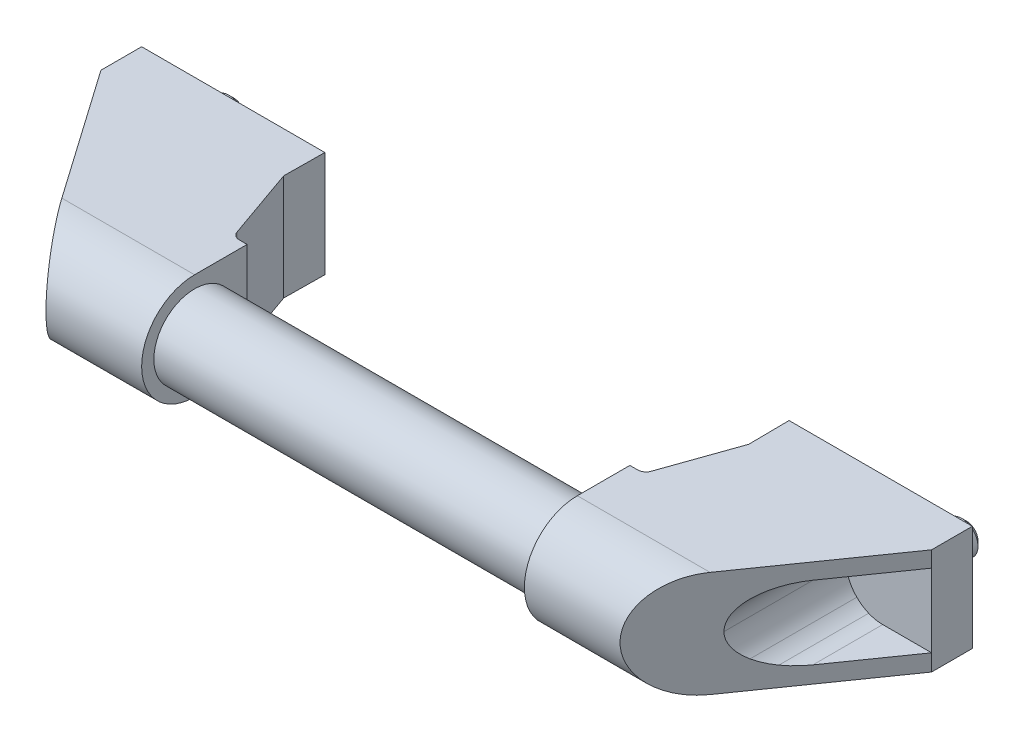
ISO-10303-21;
HEADER;
FILE_DESCRIPTION(('STEP AP214'),'2;1');
FILE_NAME('part.step','',(''),(''),'','','');
FILE_SCHEMA(('AUTOMOTIVE_DESIGN { 1 0 10303 214 1 1 1 1 }'));
ENDSEC;
DATA;
#1=APPLICATION_CONTEXT('core data for automotive mechanical design processes');
#2=APPLICATION_PROTOCOL_DEFINITION('international standard','automotive_design',2000,#1);
#3=PRODUCT_CONTEXT('',#1,'mechanical');
#4=PRODUCT('Part','Part','',(#3));
#5=PRODUCT_RELATED_PRODUCT_CATEGORY('part','',(#4));
#6=PRODUCT_DEFINITION_FORMATION('','',#4);
#7=PRODUCT_DEFINITION_CONTEXT('part definition',#1,'design');
#8=PRODUCT_DEFINITION('design','',#6,#7);
#9=PRODUCT_DEFINITION_SHAPE('','',#8);
#10=(LENGTH_UNIT() NAMED_UNIT(*) SI_UNIT(.MILLI.,.METRE.));
#11=(NAMED_UNIT(*) PLANE_ANGLE_UNIT() SI_UNIT($,.RADIAN.));
#12=(NAMED_UNIT(*) SI_UNIT($,.STERADIAN.) SOLID_ANGLE_UNIT());
#13=UNCERTAINTY_MEASURE_WITH_UNIT(LENGTH_MEASURE(1.E-05),#10,'distance_accuracy_value','');
#14=(GEOMETRIC_REPRESENTATION_CONTEXT(3) GLOBAL_UNCERTAINTY_ASSIGNED_CONTEXT((#13)) GLOBAL_UNIT_ASSIGNED_CONTEXT((#10,
#11,#12)) REPRESENTATION_CONTEXT('',''));
#15=CARTESIAN_POINT('',(0.,0.,0.));
#16=DIRECTION('',(0.,0.,1.));
#17=DIRECTION('',(1.,0.,0.));
#18=AXIS2_PLACEMENT_3D('',#15,#16,#17);
#19=CARTESIAN_POINT('',(43.,0.,42.));
#20=DIRECTION('',(-1.,0.,0.));
#21=DIRECTION('',(0.,1.,0.));
#22=AXIS2_PLACEMENT_3D('',#19,#20,#21);
#23=PLANE('',#22);
#24=DIRECTION('',(0.,1.,0.));
#25=VECTOR('',#24,1.);
#26=CARTESIAN_POINT('',(43.,-13.,29.106429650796));
#27=LINE('',#26,#25);
#28=CARTESIAN_POINT('',(43.,-13.,29.106429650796));
#29=VERTEX_POINT('',#28);
#30=CARTESIAN_POINT('',(43.,13.,29.106429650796));
#31=VERTEX_POINT('',#30);
#32=EDGE_CURVE('E403',#29,#31,#27,.T.);
#33=ORIENTED_EDGE('',*,*,#32,.T.);
#34=DIRECTION('',(0.,0.,-1.));
#35=VECTOR('',#34,1.);
#36=CARTESIAN_POINT('',(43.,13.,42.));
#37=LINE('',#36,#35);
#38=CARTESIAN_POINT('',(43.,13.,42.));
#39=VERTEX_POINT('',#38);
#40=EDGE_CURVE('E426',#39,#31,#37,.T.);
#41=ORIENTED_EDGE('',*,*,#40,.F.);
#42=CARTESIAN_POINT('',(43.,0.,42.));
#43=DIRECTION('',(1.,0.,0.));
#44=DIRECTION('',(0.,1.,0.));
#45=AXIS2_PLACEMENT_3D('',#42,#43,#44);
#46=CIRCLE('',#45,13.);
#47=CARTESIAN_POINT('',(43.,-13.,42.));
#48=VERTEX_POINT('',#47);
#49=EDGE_CURVE('E432',#39,#48,#46,.T.);
#50=ORIENTED_EDGE('',*,*,#49,.T.);
#51=DIRECTION('',(0.,0.,-1.));
#52=VECTOR('',#51,1.);
#53=CARTESIAN_POINT('',(43.,-13.,42.));
#54=LINE('',#53,#52);
#55=EDGE_CURVE('E429',#48,#29,#54,.T.);
#56=ORIENTED_EDGE('',*,*,#55,.T.);
#57=EDGE_LOOP('',(#33,#41,#50,#56));
#58=FACE_BOUND('',#57,.T.);
#59=CARTESIAN_POINT('',(43.,0.,42.));
#60=DIRECTION('',(-1.,0.,0.));
#61=DIRECTION('',(0.,0.,1.));
#62=AXIS2_PLACEMENT_3D('',#59,#60,#61);
#63=CIRCLE('',#62,10.);
#64=CARTESIAN_POINT('',(43.,0.,52.));
#65=VERTEX_POINT('',#64);
#66=EDGE_CURVE('E1265',#65,#65,#63,.T.);
#67=ORIENTED_EDGE('',*,*,#66,.T.);
#68=EDGE_LOOP('',(#67));
#69=FACE_BOUND('',#68,.T.);
#70=ADVANCED_FACE('F14',(#58,#69),#23,.F.);
#71=CARTESIAN_POINT('',(-12.,13.,0.));
#72=DIRECTION('',(0.,0.,-1.));
#73=DIRECTION('',(1.,0.,0.));
#74=AXIS2_PLACEMENT_3D('',#71,#72,#73);
#75=PLANE('',#74);
#76=DIRECTION('',(0.,-1.,0.));
#77=VECTOR('',#76,1.);
#78=CARTESIAN_POINT('',(13.,8.,0.));
#79=LINE('',#78,#77);
#80=CARTESIAN_POINT('',(13.,8.,0.));
#81=VERTEX_POINT('',#80);
#82=CARTESIAN_POINT('',(13.,-8.,0.));
#83=VERTEX_POINT('',#82);
#84=EDGE_CURVE('E318',#81,#83,#79,.T.);
#85=ORIENTED_EDGE('',*,*,#84,.T.);
#86=DIRECTION('',(-1.,0.,0.));
#87=VECTOR('',#86,1.);
#88=CARTESIAN_POINT('',(28.,-8.,0.));
#89=LINE('',#88,#87);
#90=CARTESIAN_POINT('',(28.,-8.,0.));
#91=VERTEX_POINT('',#90);
#92=EDGE_CURVE('E305',#91,#83,#89,.T.);
#93=ORIENTED_EDGE('',*,*,#92,.F.);
#94=DIRECTION('',(0.,1.,0.));
#95=VECTOR('',#94,1.);
#96=CARTESIAN_POINT('',(28.,-8.,0.));
#97=LINE('',#96,#95);
#98=CARTESIAN_POINT('',(28.,8.,0.));
#99=VERTEX_POINT('',#98);
#100=EDGE_CURVE('E287',#91,#99,#97,.T.);
#101=ORIENTED_EDGE('',*,*,#100,.T.);
#102=DIRECTION('',(1.,0.,0.));
#103=VECTOR('',#102,1.);
#104=CARTESIAN_POINT('',(13.,8.,0.));
#105=LINE('',#104,#103);
#106=EDGE_CURVE('E302',#81,#99,#105,.T.);
#107=ORIENTED_EDGE('',*,*,#106,.F.);
#108=EDGE_LOOP('',(#85,#93,#101,#107));
#109=FACE_BOUND('',#108,.T.);
#110=DIRECTION('',(0.,1.,0.));
#111=VECTOR('',#110,1.);
#112=CARTESIAN_POINT('',(33.,-13.,0.));
#113=LINE('',#112,#111);
#114=CARTESIAN_POINT('',(33.,-13.,0.));
#115=VERTEX_POINT('',#114);
#116=CARTESIAN_POINT('',(33.,13.,0.));
#117=VERTEX_POINT('',#116);
#118=EDGE_CURVE('E411',#115,#117,#113,.T.);
#119=ORIENTED_EDGE('',*,*,#118,.F.);
#120=DIRECTION('',(1.,0.,0.));
#121=VECTOR('',#120,1.);
#122=CARTESIAN_POINT('',(-12.,-13.,0.));
#123=LINE('',#122,#121);
#124=CARTESIAN_POINT('',(-12.,-13.,0.));
#125=VERTEX_POINT('',#124);
#126=EDGE_CURVE('E445',#125,#115,#123,.T.);
#127=ORIENTED_EDGE('',*,*,#126,.F.);
#128=DIRECTION('',(0.,-1.,0.));
#129=VECTOR('',#128,1.);
#130=CARTESIAN_POINT('',(-12.,13.,0.));
#131=LINE('',#130,#129);
#132=CARTESIAN_POINT('',(-12.,13.,0.));
#133=VERTEX_POINT('',#132);
#134=EDGE_CURVE('E437',#133,#125,#131,.T.);
#135=ORIENTED_EDGE('',*,*,#134,.F.);
#136=DIRECTION('',(1.,0.,0.));
#137=VECTOR('',#136,1.);
#138=CARTESIAN_POINT('',(-12.,13.,0.));
#139=LINE('',#138,#137);
#140=EDGE_CURVE('E442',#133,#117,#139,.T.);
#141=ORIENTED_EDGE('',*,*,#140,.T.);
#142=EDGE_LOOP('',(#119,#127,#135,#141));
#143=FACE_BOUND('',#142,.T.);
#144=CARTESIAN_POINT('',(0.,0.,0.));
#145=DIRECTION('',(0.,0.,-1.));
#146=DIRECTION('',(-1.,0.,0.));
#147=AXIS2_PLACEMENT_3D('',#144,#145,#146);
#148=CIRCLE('',#147,4.);
#149=CARTESIAN_POINT('',(-4.,0.,0.));
#150=VERTEX_POINT('',#149);
#151=EDGE_CURVE('E1259',#150,#150,#148,.T.);
#152=ORIENTED_EDGE('',*,*,#151,.F.);
#153=EDGE_LOOP('',(#152));
#154=FACE_BOUND('',#153,.T.);
#155=ADVANCED_FACE('F300',(#109,#143,#154),#75,.T.);
#156=CARTESIAN_POINT('',(-12.,-13.,10.));
#157=DIRECTION('',(0.819152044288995,0.,-0.573576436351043));
#158=DIRECTION('',(0.573576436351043,0.,0.819152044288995));
#159=AXIS2_PLACEMENT_3D('',#156,#157,#158);
#160=PLANE('',#159);
#161=DIRECTION('',(-0.573576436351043,0.,-0.819152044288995));
#162=VECTOR('',#161,1.);
#163=CARTESIAN_POINT('',(-12.,-8.90119415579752,10.));
#164=LINE('',#163,#162);
#165=CARTESIAN_POINT('',(7.15225743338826E-06,-8.90119415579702,27.137786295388));
#166=VERTEX_POINT('',#165);
#167=CARTESIAN_POINT('',(-12.,-8.90119415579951,10.));
#168=VERTEX_POINT('',#167);
#169=EDGE_CURVE('E473',#166,#168,#164,.T.);
#170=ORIENTED_EDGE('',*,*,#169,.T.);
#171=DIRECTION('',(0.,1.,0.));
#172=VECTOR('',#171,1.);
#173=CARTESIAN_POINT('',(-12.,-13.,10.));
#174=LINE('',#173,#172);
#175=CARTESIAN_POINT('',(-12.,-13.,10.));
#176=VERTEX_POINT('',#175);
#177=EDGE_CURVE('E421',#176,#168,#174,.T.);
#178=ORIENTED_EDGE('',*,*,#177,.F.);
#179=DIRECTION('',(0.573576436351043,0.,0.819152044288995));
#180=VECTOR('',#179,1.);
#181=CARTESIAN_POINT('',(-12.,-13.,10.));
#182=LINE('',#181,#180);
#183=CARTESIAN_POINT('',(10.4066412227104,-13.,42.));
#184=VERTEX_POINT('',#183);
#185=EDGE_CURVE('E417',#176,#184,#182,.T.);
#186=ORIENTED_EDGE('',*,*,#185,.T.);
#187=CARTESIAN_POINT('',(10.4066412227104,0.,42.));
#188=DIRECTION('',(-0.819152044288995,0.,0.573576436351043));
#189=DIRECTION('',(0.573576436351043,0.,0.819152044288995));
#190=AXIS2_PLACEMENT_3D('',#187,#188,#189);
#191=ELLIPSE('',#190,15.8700696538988,13.);
#192=CARTESIAN_POINT('',(10.4066412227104,13.,42.));
#193=VERTEX_POINT('',#192);
#194=EDGE_CURVE('E424',#184,#193,#191,.T.);
#195=ORIENTED_EDGE('',*,*,#194,.T.);
#196=DIRECTION('',(0.573576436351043,0.,0.819152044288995));
#197=VECTOR('',#196,1.);
#198=CARTESIAN_POINT('',(-12.,13.,10.));
#199=LINE('',#198,#197);
#200=CARTESIAN_POINT('',(-12.,13.,10.));
#201=VERTEX_POINT('',#200);
#202=EDGE_CURVE('E414',#201,#193,#199,.T.);
#203=ORIENTED_EDGE('',*,*,#202,.F.);
#204=CARTESIAN_POINT('',(-12.,9.09880893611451,10.));
#205=VERTEX_POINT('',#204);
#206=EDGE_CURVE('E420',#205,#201,#174,.T.);
#207=ORIENTED_EDGE('',*,*,#206,.F.);
#208=DIRECTION('',(-0.573576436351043,0.,-0.819152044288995));
#209=VECTOR('',#208,1.);
#210=CARTESIAN_POINT('',(-12.,9.09880893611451,10.));
#211=LINE('',#210,#209);
#212=CARTESIAN_POINT('',(0.,9.09880893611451,27.1377760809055));
#213=VERTEX_POINT('',#212);
#214=EDGE_CURVE('E452',#213,#205,#211,.T.);
#215=ORIENTED_EDGE('',*,*,#214,.F.);
#216=CARTESIAN_POINT('',(-6.61501418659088E-06,0.098772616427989,27.1377666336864));
#217=DIRECTION('',(-0.819152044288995,0.,0.573576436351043));
#218=DIRECTION('',(0.573576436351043,0.,0.819152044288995));
#219=AXIS2_PLACEMENT_3D('',#216,#217,#218);
#220=ELLIPSE('',#219,15.691084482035,9.0000363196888);
#221=CARTESIAN_POINT('',(3.44415099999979,8.4137249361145,32.0565334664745));
#222=VERTEX_POINT('',#221);
#223=EDGE_CURVE('E455',#222,#213,#220,.T.);
#224=ORIENTED_EDGE('',*,*,#223,.F.);
#225=CARTESIAN_POINT('',(-2.10368270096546E-05,0.0987787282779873,27.137746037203));
#226=DIRECTION('',(-0.819152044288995,0.,0.573576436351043));
#227=DIRECTION('',(0.573576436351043,0.,0.819152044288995));
#228=AXIS2_PLACEMENT_3D('',#225,#226,#227);
#229=ELLIPSE('',#228,15.6910842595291,9.00003619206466);
#230=CARTESIAN_POINT('',(6.36396099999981,6.4627699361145,36.22645429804));
#231=VERTEX_POINT('',#230);
#232=EDGE_CURVE('E458',#231,#222,#229,.T.);
#233=ORIENTED_EDGE('',*,*,#232,.F.);
#234=CARTESIAN_POINT('',(-3.070783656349E-05,0.098790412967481,27.13773222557));
#235=DIRECTION('',(-0.819152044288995,0.,0.573576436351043));
#236=DIRECTION('',(0.573576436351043,0.,0.819152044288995));
#237=AXIS2_PLACEMENT_3D('',#234,#235,#236);
#238=ELLIPSE('',#237,15.6910817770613,9.00003476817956);
#239=CARTESIAN_POINT('',(9.00000406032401,0.0988089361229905,39.9911139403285));
#240=VERTEX_POINT('',#239);
#241=EDGE_CURVE('E461',#240,#231,#238,.T.);
#242=ORIENTED_EDGE('',*,*,#241,.F.);
#243=CARTESIAN_POINT('',(-3.27593623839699E-05,0.0988180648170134,27.1377292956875));
#244=DIRECTION('',(-0.819152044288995,0.,0.573576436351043));
#245=DIRECTION('',(0.573576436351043,0.,0.819152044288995));
#246=AXIS2_PLACEMENT_3D('',#243,#244,#245);
#247=ELLIPSE('',#246,15.6910853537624,9.00003681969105);
#248=CARTESIAN_POINT('',(6.36396815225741,-6.26515515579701,36.2264645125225));
#249=VERTEX_POINT('',#248);
#250=EDGE_CURVE('E464',#249,#240,#247,.T.);
#251=ORIENTED_EDGE('',*,*,#250,.F.);
#252=CARTESIAN_POINT('',(-1.38845695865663E-05,0.0988360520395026,27.1377562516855));
#253=DIRECTION('',(-0.819152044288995,0.,0.573576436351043));
#254=DIRECTION('',(0.573576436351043,0.,0.819152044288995));
#255=AXIS2_PLACEMENT_3D('',#252,#253,#254);
#256=ELLIPSE('',#255,15.6910842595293,9.00003619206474);
#257=CARTESIAN_POINT('',(3.44415815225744,-8.21611015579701,32.0565436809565));
#258=VERTEX_POINT('',#257);
#259=EDGE_CURVE('E467',#258,#249,#256,.T.);
#260=ORIENTED_EDGE('',*,*,#259,.F.);
#261=CARTESIAN_POINT('',(5.3724321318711E-07,0.0988421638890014,27.1377768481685));
#262=DIRECTION('',(-0.819152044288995,0.,0.573576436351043));
#263=DIRECTION('',(0.573576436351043,0.,0.819152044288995));
#264=AXIS2_PLACEMENT_3D('',#261,#262,#263);
#265=ELLIPSE('',#264,15.6910844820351,9.00003631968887);
#266=EDGE_CURVE('E470',#166,#258,#265,.T.);
#267=ORIENTED_EDGE('',*,*,#266,.F.);
#268=EDGE_LOOP('',(#170,#178,#186,#195,#203,#207,#215,#224,#233,#242,#251,#260,#267));
#269=FACE_BOUND('',#268,.T.);
#270=ADVANCED_FACE('F733',(#269),#160,.F.);
#271=CARTESIAN_POINT('',(-12.,13.,42.));
#272=DIRECTION('',(0.,1.,0.));
#273=DIRECTION('',(1.,0.,0.));
#274=AXIS2_PLACEMENT_3D('',#271,#272,#273);
#275=PLANE('',#274);
#276=DIRECTION('',(0.0104830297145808,0.,-0.999945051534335));
#277=VECTOR('',#276,1.);
#278=CARTESIAN_POINT('',(32.895169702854,13.,9.99945051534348));
#279=LINE('',#278,#277);
#280=CARTESIAN_POINT('',(32.895169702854,13.,9.99945051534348));
#281=VERTEX_POINT('',#280);
#282=EDGE_CURVE('E389',#281,#117,#279,.T.);
#283=ORIENTED_EDGE('',*,*,#282,.T.);
#284=ORIENTED_EDGE('',*,*,#140,.F.);
#285=DIRECTION('',(0.,0.,-1.));
#286=VECTOR('',#285,1.);
#287=CARTESIAN_POINT('',(-12.,13.,42.));
#288=LINE('',#287,#286);
#289=EDGE_CURVE('E435',#201,#133,#288,.T.);
#290=ORIENTED_EDGE('',*,*,#289,.F.);
#291=ORIENTED_EDGE('',*,*,#202,.T.);
#292=DIRECTION('',(1.,0.,0.));
#293=VECTOR('',#292,1.);
#294=CARTESIAN_POINT('',(-12.,13.,42.));
#295=LINE('',#294,#293);
#296=EDGE_CURVE('E450',#193,#39,#295,.T.);
#297=ORIENTED_EDGE('',*,*,#296,.T.);
#298=ORIENTED_EDGE('',*,*,#40,.T.);
#299=DIRECTION('',(-0.999945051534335,0.,-0.0104830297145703));
#300=VECTOR('',#299,1.);
#301=CARTESIAN_POINT('',(43.,13.,29.106429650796));
#302=LINE('',#301,#300);
#303=CARTESIAN_POINT('',(41.0113841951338,13.,29.0855817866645));
#304=VERTEX_POINT('',#303);
#305=EDGE_CURVE('E380',#31,#304,#302,.T.);
#306=ORIENTED_EDGE('',*,*,#305,.T.);
#307=CARTESIAN_POINT('',(41.0323502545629,13.,27.085691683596));
#308=DIRECTION('',(0.,-1.,0.));
#309=DIRECTION('',(1.,0.,0.));
#310=AXIS2_PLACEMENT_3D('',#307,#308,#309);
#311=CIRCLE('',#310,2.);
#312=CARTESIAN_POINT('',(39.1458974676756,13.,27.7499927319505));
#313=VERTEX_POINT('',#312);
#314=EDGE_CURVE('E383',#304,#313,#311,.T.);
#315=ORIENTED_EDGE('',*,*,#314,.T.);
#316=DIRECTION('',(0.332150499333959,0.,0.943226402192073));
#317=VECTOR('',#316,1.);
#318=CARTESIAN_POINT('',(32.895169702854,13.,9.99945051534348));
#319=LINE('',#318,#317);
#320=EDGE_CURVE('E386',#281,#313,#319,.T.);
#321=ORIENTED_EDGE('',*,*,#320,.F.);
#322=EDGE_LOOP('',(#283,#284,#290,#291,#297,#298,#306,#315,#321));
#323=FACE_BOUND('',#322,.T.);
#324=ADVANCED_FACE('F745',(#323),#275,.T.);
#325=CARTESIAN_POINT('',(-12.,0.,42.));
#326=DIRECTION('',(1.,0.,0.));
#327=DIRECTION('',(0.,-1.,0.));
#328=AXIS2_PLACEMENT_3D('',#325,#326,#327);
#329=CYLINDRICAL_SURFACE('',#328,13.);
#330=ORIENTED_EDGE('',*,*,#194,.F.);
#331=DIRECTION('',(1.,0.,0.));
#332=VECTOR('',#331,1.);
#333=CARTESIAN_POINT('',(-12.,-13.,42.));
#334=LINE('',#333,#332);
#335=EDGE_CURVE('E448',#184,#48,#334,.T.);
#336=ORIENTED_EDGE('',*,*,#335,.T.);
#337=ORIENTED_EDGE('',*,*,#49,.F.);
#338=ORIENTED_EDGE('',*,*,#296,.F.);
#339=EDGE_LOOP('',(#330,#336,#337,#338));
#340=FACE_BOUND('',#339,.T.);
#341=ADVANCED_FACE('F747',(#340),#329,.T.);
#342=CARTESIAN_POINT('',(-12.,-13.,42.));
#343=DIRECTION('',(0.,1.,0.));
#344=DIRECTION('',(1.,0.,0.));
#345=AXIS2_PLACEMENT_3D('',#342,#343,#344);
#346=PLANE('',#345);
#347=DIRECTION('',(0.332150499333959,0.,0.943226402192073));
#348=VECTOR('',#347,1.);
#349=CARTESIAN_POINT('',(32.895169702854,-13.,9.99945051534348));
#350=LINE('',#349,#348);
#351=CARTESIAN_POINT('',(32.895169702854,-13.,9.99945051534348));
#352=VERTEX_POINT('',#351);
#353=CARTESIAN_POINT('',(39.1458974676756,-13.,27.7499927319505));
#354=VERTEX_POINT('',#353);
#355=EDGE_CURVE('E397',#352,#354,#350,.T.);
#356=ORIENTED_EDGE('',*,*,#355,.T.);
#357=CARTESIAN_POINT('',(41.0323502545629,-13.,27.085691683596));
#358=DIRECTION('',(0.,-1.,0.));
#359=DIRECTION('',(1.,0.,0.));
#360=AXIS2_PLACEMENT_3D('',#357,#358,#359);
#361=CIRCLE('',#360,2.);
#362=CARTESIAN_POINT('',(41.0113841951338,-13.,29.0855817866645));
#363=VERTEX_POINT('',#362);
#364=EDGE_CURVE('E394',#363,#354,#361,.T.);
#365=ORIENTED_EDGE('',*,*,#364,.F.);
#366=DIRECTION('',(-0.999945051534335,0.,-0.0104830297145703));
#367=VECTOR('',#366,1.);
#368=CARTESIAN_POINT('',(43.,-13.,29.106429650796));
#369=LINE('',#368,#367);
#370=EDGE_CURVE('E391',#29,#363,#369,.T.);
#371=ORIENTED_EDGE('',*,*,#370,.F.);
#372=ORIENTED_EDGE('',*,*,#55,.F.);
#373=ORIENTED_EDGE('',*,*,#335,.F.);
#374=ORIENTED_EDGE('',*,*,#185,.F.);
#375=DIRECTION('',(0.,0.,-1.));
#376=VECTOR('',#375,1.);
#377=CARTESIAN_POINT('',(-12.,-13.,42.));
#378=LINE('',#377,#376);
#379=EDGE_CURVE('E440',#176,#125,#378,.T.);
#380=ORIENTED_EDGE('',*,*,#379,.T.);
#381=ORIENTED_EDGE('',*,*,#126,.T.);
#382=DIRECTION('',(0.0104830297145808,0.,-0.999945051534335));
#383=VECTOR('',#382,1.);
#384=CARTESIAN_POINT('',(32.895169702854,-13.,9.99945051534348));
#385=LINE('',#384,#383);
#386=EDGE_CURVE('E400',#352,#115,#385,.T.);
#387=ORIENTED_EDGE('',*,*,#386,.F.);
#388=EDGE_LOOP('',(#356,#365,#371,#372,#373,#374,#380,#381,#387));
#389=FACE_BOUND('',#388,.T.);
#390=ADVANCED_FACE('F743',(#389),#346,.F.);
#391=CARTESIAN_POINT('',(-12.,0.,42.));
#392=DIRECTION('',(-1.,0.,0.));
#393=DIRECTION('',(0.,1.,0.));
#394=AXIS2_PLACEMENT_3D('',#391,#392,#393);
#395=PLANE('',#394);
#396=ORIENTED_EDGE('',*,*,#177,.T.);
#397=DIRECTION('',(0.,1.,0.));
#398=VECTOR('',#397,1.);
#399=CARTESIAN_POINT('',(-12.,-8.90119415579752,10.));
#400=LINE('',#399,#398);
#401=EDGE_CURVE('E356',#168,#205,#400,.T.);
#402=ORIENTED_EDGE('',*,*,#401,.T.);
#403=ORIENTED_EDGE('',*,*,#206,.T.);
#404=ORIENTED_EDGE('',*,*,#289,.T.);
#405=ORIENTED_EDGE('',*,*,#134,.T.);
#406=ORIENTED_EDGE('',*,*,#379,.F.);
#407=EDGE_LOOP('',(#396,#402,#403,#404,#405,#406));
#408=FACE_BOUND('',#407,.T.);
#409=ADVANCED_FACE('F739',(#408),#395,.T.);
#410=CARTESIAN_POINT('',(32.895169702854,-13.,9.99945051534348));
#411=DIRECTION('',(-0.999945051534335,0.,-0.0104830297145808));
#412=DIRECTION('',(0.0104830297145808,0.,-0.999945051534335));
#413=AXIS2_PLACEMENT_3D('',#410,#411,#412);
#414=PLANE('',#413);
#415=DIRECTION('',(0.,1.,0.));
#416=VECTOR('',#415,1.);
#417=CARTESIAN_POINT('',(32.895169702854,-13.,9.99945051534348));
#418=LINE('',#417,#416);
#419=EDGE_CURVE('E409',#352,#281,#418,.T.);
#420=ORIENTED_EDGE('',*,*,#419,.F.);
#421=ORIENTED_EDGE('',*,*,#386,.T.);
#422=ORIENTED_EDGE('',*,*,#118,.T.);
#423=ORIENTED_EDGE('',*,*,#282,.F.);
#424=EDGE_LOOP('',(#420,#421,#422,#423));
#425=FACE_BOUND('',#424,.T.);
#426=ADVANCED_FACE('F742',(#425),#414,.F.);
#427=CARTESIAN_POINT('',(32.895169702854,-13.,9.99945051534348));
#428=DIRECTION('',(0.943226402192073,0.,-0.332150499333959));
#429=DIRECTION('',(0.332150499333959,0.,0.943226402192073));
#430=AXIS2_PLACEMENT_3D('',#427,#428,#429);
#431=PLANE('',#430);
#432=DIRECTION('',(0.,1.,0.));
#433=VECTOR('',#432,1.);
#434=CARTESIAN_POINT('',(39.1458974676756,-13.,27.7499927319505));
#435=LINE('',#434,#433);
#436=EDGE_CURVE('E407',#354,#313,#435,.T.);
#437=ORIENTED_EDGE('',*,*,#436,.F.);
#438=ORIENTED_EDGE('',*,*,#355,.F.);
#439=ORIENTED_EDGE('',*,*,#419,.T.);
#440=ORIENTED_EDGE('',*,*,#320,.T.);
#441=EDGE_LOOP('',(#437,#438,#439,#440));
#442=FACE_BOUND('',#441,.T.);
#443=ADVANCED_FACE('F1203',(#442),#431,.T.);
#444=CARTESIAN_POINT('',(41.0323502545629,-13.,27.085691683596));
#445=DIRECTION('',(0.,1.,0.));
#446=DIRECTION('',(1.,0.,0.));
#447=AXIS2_PLACEMENT_3D('',#444,#445,#446);
#448=CYLINDRICAL_SURFACE('',#447,2.);
#449=DIRECTION('',(0.,1.,0.));
#450=VECTOR('',#449,1.);
#451=CARTESIAN_POINT('',(41.0113841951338,-13.,29.0855817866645));
#452=LINE('',#451,#450);
#453=EDGE_CURVE('E405',#363,#304,#452,.T.);
#454=ORIENTED_EDGE('',*,*,#453,.F.);
#455=ORIENTED_EDGE('',*,*,#364,.T.);
#456=ORIENTED_EDGE('',*,*,#436,.T.);
#457=ORIENTED_EDGE('',*,*,#314,.F.);
#458=EDGE_LOOP('',(#454,#455,#456,#457));
#459=FACE_BOUND('',#458,.T.);
#460=ADVANCED_FACE('F1194',(#459),#448,.F.);
#461=CARTESIAN_POINT('',(43.,-13.,29.106429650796));
#462=DIRECTION('',(-0.0104830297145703,0.,0.999945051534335));
#463=DIRECTION('',(-0.999945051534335,0.,-0.0104830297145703));
#464=AXIS2_PLACEMENT_3D('',#461,#462,#463);
#465=PLANE('',#464);
#466=ORIENTED_EDGE('',*,*,#32,.F.);
#467=ORIENTED_EDGE('',*,*,#370,.T.);
#468=ORIENTED_EDGE('',*,*,#453,.T.);
#469=ORIENTED_EDGE('',*,*,#305,.F.);
#470=EDGE_LOOP('',(#466,#467,#468,#469));
#471=FACE_BOUND('',#470,.T.);
#472=ADVANCED_FACE('F1185',(#471),#465,.F.);
#473=CARTESIAN_POINT('',(-12.,-8.90119415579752,10.));
#474=DIRECTION('',(0.,1.,0.));
#475=DIRECTION('',(1.,0.,0.));
#476=AXIS2_PLACEMENT_3D('',#473,#474,#475);
#477=PLANE('',#476);
#478=ORIENTED_EDGE('',*,*,#169,.F.);
#479=DIRECTION('',(0.,0.,1.));
#480=VECTOR('',#479,1.);
#481=CARTESIAN_POINT('',(7.15225741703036E-06,-8.90119415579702,10.));
#482=LINE('',#481,#480);
#483=CARTESIAN_POINT('',(7.15225741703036E-06,-8.90119415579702,10.));
#484=VERTEX_POINT('',#483);
#485=EDGE_CURVE('E377',#484,#166,#482,.T.);
#486=ORIENTED_EDGE('',*,*,#485,.F.);
#487=DIRECTION('',(1.,0.,0.));
#488=VECTOR('',#487,1.);
#489=CARTESIAN_POINT('',(-12.,-8.90119415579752,10.));
#490=LINE('',#489,#488);
#491=EDGE_CURVE('E294',#168,#484,#490,.T.);
#492=ORIENTED_EDGE('',*,*,#491,.F.);
#493=EDGE_LOOP('',(#478,#486,#492));
#494=FACE_BOUND('',#493,.T.);
#495=ADVANCED_FACE('F1176',(#494),#477,.T.);
#496=CARTESIAN_POINT('',(5.37243216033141E-07,0.0988421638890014,10.));
#497=DIRECTION('',(0.,0.,1.));
#498=DIRECTION('',(-1.,0.,0.));
#499=AXIS2_PLACEMENT_3D('',#496,#497,#498);
#500=CYLINDRICAL_SURFACE('',#499,9.00003631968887);
#501=ORIENTED_EDGE('',*,*,#485,.T.);
#502=ORIENTED_EDGE('',*,*,#266,.T.);
#503=DIRECTION('',(0.,0.,1.));
#504=VECTOR('',#503,1.);
#505=CARTESIAN_POINT('',(3.44415815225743,-8.21611015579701,10.));
#506=LINE('',#505,#504);
#507=CARTESIAN_POINT('',(3.44415815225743,-8.21611015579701,10.));
#508=VERTEX_POINT('',#507);
#509=EDGE_CURVE('E374',#508,#258,#506,.T.);
#510=ORIENTED_EDGE('',*,*,#509,.F.);
#511=CARTESIAN_POINT('',(5.37243216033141E-07,0.0988421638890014,10.));
#512=DIRECTION('',(0.,0.,-1.));
#513=DIRECTION('',(-1.,0.,0.));
#514=AXIS2_PLACEMENT_3D('',#511,#512,#513);
#515=CIRCLE('',#514,9.00003631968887);
#516=EDGE_CURVE('E335',#508,#484,#515,.T.);
#517=ORIENTED_EDGE('',*,*,#516,.T.);
#518=EDGE_LOOP('',(#501,#502,#510,#517));
#519=FACE_BOUND('',#518,.T.);
#520=ADVANCED_FACE('F1167',(#519),#500,.F.);
#521=CARTESIAN_POINT('',(-1.38845693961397E-05,0.0988360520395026,10.));
#522=DIRECTION('',(0.,0.,1.));
#523=DIRECTION('',(-1.,0.,0.));
#524=AXIS2_PLACEMENT_3D('',#521,#522,#523);
#525=CYLINDRICAL_SURFACE('',#524,9.00003619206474);
#526=ORIENTED_EDGE('',*,*,#509,.T.);
#527=ORIENTED_EDGE('',*,*,#259,.T.);
#528=DIRECTION('',(0.,0.,1.));
#529=VECTOR('',#528,1.);
#530=CARTESIAN_POINT('',(6.36396815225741,-6.26515515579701,10.));
#531=LINE('',#530,#529);
#532=CARTESIAN_POINT('',(6.36396815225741,-6.26515515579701,10.));
#533=VERTEX_POINT('',#532);
#534=EDGE_CURVE('E371',#533,#249,#531,.T.);
#535=ORIENTED_EDGE('',*,*,#534,.F.);
#536=CARTESIAN_POINT('',(-1.38845693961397E-05,0.0988360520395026,10.));
#537=DIRECTION('',(0.,0.,-1.));
#538=DIRECTION('',(-1.,0.,0.));
#539=AXIS2_PLACEMENT_3D('',#536,#537,#538);
#540=CIRCLE('',#539,9.00003619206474);
#541=EDGE_CURVE('E338',#533,#508,#540,.T.);
#542=ORIENTED_EDGE('',*,*,#541,.T.);
#543=EDGE_LOOP('',(#526,#527,#535,#542));
#544=FACE_BOUND('',#543,.T.);
#545=ADVANCED_FACE('F1158',(#544),#525,.F.);
#546=CARTESIAN_POINT('',(-3.27593624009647E-05,0.0988180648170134,10.));
#547=DIRECTION('',(0.,0.,1.));
#548=DIRECTION('',(-1.,0.,0.));
#549=AXIS2_PLACEMENT_3D('',#546,#547,#548);
#550=CYLINDRICAL_SURFACE('',#549,9.00003681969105);
#551=ORIENTED_EDGE('',*,*,#534,.T.);
#552=ORIENTED_EDGE('',*,*,#250,.T.);
#553=DIRECTION('',(0.,0.,1.));
#554=VECTOR('',#553,1.);
#555=CARTESIAN_POINT('',(9.00000406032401,0.0988089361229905,10.));
#556=LINE('',#555,#554);
#557=CARTESIAN_POINT('',(9.00000406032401,0.0988089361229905,10.));
#558=VERTEX_POINT('',#557);
#559=EDGE_CURVE('E368',#558,#240,#556,.T.);
#560=ORIENTED_EDGE('',*,*,#559,.F.);
#561=CARTESIAN_POINT('',(-3.27593624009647E-05,0.0988180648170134,10.));
#562=DIRECTION('',(0.,0.,-1.));
#563=DIRECTION('',(-1.,0.,0.));
#564=AXIS2_PLACEMENT_3D('',#561,#562,#563);
#565=CIRCLE('',#564,9.00003681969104);
#566=EDGE_CURVE('E341',#558,#533,#565,.T.);
#567=ORIENTED_EDGE('',*,*,#566,.T.);
#568=EDGE_LOOP('',(#551,#552,#560,#567));
#569=FACE_BOUND('',#568,.T.);
#570=ADVANCED_FACE('F1149',(#569),#550,.F.);
#571=CARTESIAN_POINT('',(-3.07078365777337E-05,0.098790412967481,10.));
#572=DIRECTION('',(0.,0.,1.));
#573=DIRECTION('',(-1.,0.,0.));
#574=AXIS2_PLACEMENT_3D('',#571,#572,#573);
#575=CYLINDRICAL_SURFACE('',#574,9.00003476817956);
#576=ORIENTED_EDGE('',*,*,#559,.T.);
#577=ORIENTED_EDGE('',*,*,#241,.T.);
#578=DIRECTION('',(0.,0.,1.));
#579=VECTOR('',#578,1.);
#580=CARTESIAN_POINT('',(6.36396099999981,6.4627699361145,10.));
#581=LINE('',#580,#579);
#582=CARTESIAN_POINT('',(6.36396099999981,6.4627699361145,10.));
#583=VERTEX_POINT('',#582);
#584=EDGE_CURVE('E365',#583,#231,#581,.T.);
#585=ORIENTED_EDGE('',*,*,#584,.F.);
#586=CARTESIAN_POINT('',(-3.07078365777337E-05,0.098790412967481,10.));
#587=DIRECTION('',(0.,0.,-1.));
#588=DIRECTION('',(-1.,0.,0.));
#589=AXIS2_PLACEMENT_3D('',#586,#587,#588);
#590=CIRCLE('',#589,9.00003476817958);
#591=EDGE_CURVE('E344',#583,#558,#590,.T.);
#592=ORIENTED_EDGE('',*,*,#591,.T.);
#593=EDGE_LOOP('',(#576,#577,#585,#592));
#594=FACE_BOUND('',#593,.T.);
#595=ADVANCED_FACE('F1140',(#594),#575,.F.);
#596=CARTESIAN_POINT('',(-2.10368270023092E-05,0.0987787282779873,10.));
#597=DIRECTION('',(0.,0.,1.));
#598=DIRECTION('',(-1.,0.,0.));
#599=AXIS2_PLACEMENT_3D('',#596,#597,#598);
#600=CYLINDRICAL_SURFACE('',#599,9.00003619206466);
#601=ORIENTED_EDGE('',*,*,#584,.T.);
#602=ORIENTED_EDGE('',*,*,#232,.T.);
#603=DIRECTION('',(0.,0.,1.));
#604=VECTOR('',#603,1.);
#605=CARTESIAN_POINT('',(3.44415099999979,8.4137249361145,10.));
#606=LINE('',#605,#604);
#607=CARTESIAN_POINT('',(3.44415099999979,8.4137249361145,10.));
#608=VERTEX_POINT('',#607);
#609=EDGE_CURVE('E362',#608,#222,#606,.T.);
#610=ORIENTED_EDGE('',*,*,#609,.F.);
#611=CARTESIAN_POINT('',(-2.10368270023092E-05,0.0987787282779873,10.));
#612=DIRECTION('',(0.,0.,-1.));
#613=DIRECTION('',(-1.,0.,0.));
#614=AXIS2_PLACEMENT_3D('',#611,#612,#613);
#615=CIRCLE('',#614,9.00003619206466);
#616=EDGE_CURVE('E347',#608,#583,#615,.T.);
#617=ORIENTED_EDGE('',*,*,#616,.T.);
#618=EDGE_LOOP('',(#601,#602,#610,#617));
#619=FACE_BOUND('',#618,.T.);
#620=ADVANCED_FACE('F1131',(#619),#600,.F.);
#621=CARTESIAN_POINT('',(-6.61501397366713E-06,0.098772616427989,10.));
#622=DIRECTION('',(0.,0.,1.));
#623=DIRECTION('',(-1.,0.,0.));
#624=AXIS2_PLACEMENT_3D('',#621,#622,#623);
#625=CYLINDRICAL_SURFACE('',#624,9.0000363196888);
#626=ORIENTED_EDGE('',*,*,#609,.T.);
#627=ORIENTED_EDGE('',*,*,#223,.T.);
#628=DIRECTION('',(0.,0.,1.));
#629=VECTOR('',#628,1.);
#630=CARTESIAN_POINT('',(0.,9.09880893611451,10.));
#631=LINE('',#630,#629);
#632=CARTESIAN_POINT('',(0.,9.09880893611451,10.));
#633=VERTEX_POINT('',#632);
#634=EDGE_CURVE('E359',#633,#213,#631,.T.);
#635=ORIENTED_EDGE('',*,*,#634,.F.);
#636=CARTESIAN_POINT('',(-6.61501397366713E-06,0.098772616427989,10.));
#637=DIRECTION('',(0.,0.,-1.));
#638=DIRECTION('',(-1.,0.,0.));
#639=AXIS2_PLACEMENT_3D('',#636,#637,#638);
#640=CIRCLE('',#639,9.0000363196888);
#641=EDGE_CURVE('E350',#633,#608,#640,.T.);
#642=ORIENTED_EDGE('',*,*,#641,.T.);
#643=EDGE_LOOP('',(#626,#627,#635,#642));
#644=FACE_BOUND('',#643,.T.);
#645=ADVANCED_FACE('F1122',(#644),#625,.F.);
#646=CARTESIAN_POINT('',(-12.,9.09880893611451,10.));
#647=DIRECTION('',(0.,1.,0.));
#648=DIRECTION('',(1.,0.,0.));
#649=AXIS2_PLACEMENT_3D('',#646,#647,#648);
#650=PLANE('',#649);
#651=ORIENTED_EDGE('',*,*,#634,.T.);
#652=ORIENTED_EDGE('',*,*,#214,.T.);
#653=DIRECTION('',(1.,0.,0.));
#654=VECTOR('',#653,1.);
#655=CARTESIAN_POINT('',(-12.,9.09880893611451,10.));
#656=LINE('',#655,#654);
#657=EDGE_CURVE('E353',#205,#633,#656,.T.);
#658=ORIENTED_EDGE('',*,*,#657,.T.);
#659=EDGE_LOOP('',(#651,#652,#658));
#660=FACE_BOUND('',#659,.T.);
#661=ADVANCED_FACE('F1113',(#660),#650,.F.);
#662=CARTESIAN_POINT('',(5.37243216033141E-07,0.0988421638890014,10.));
#663=DIRECTION('',(0.,0.,1.));
#664=DIRECTION('',(-1.,0.,0.));
#665=AXIS2_PLACEMENT_3D('',#662,#663,#664);
#666=PLANE('',#665);
#667=ORIENTED_EDGE('',*,*,#491,.T.);
#668=ORIENTED_EDGE('',*,*,#516,.F.);
#669=ORIENTED_EDGE('',*,*,#541,.F.);
#670=ORIENTED_EDGE('',*,*,#566,.F.);
#671=ORIENTED_EDGE('',*,*,#591,.F.);
#672=ORIENTED_EDGE('',*,*,#616,.F.);
#673=ORIENTED_EDGE('',*,*,#641,.F.);
#674=ORIENTED_EDGE('',*,*,#657,.F.);
#675=ORIENTED_EDGE('',*,*,#401,.F.);
#676=EDGE_LOOP('',(#667,#668,#669,#670,#671,#672,#673,#674,#675));
#677=FACE_BOUND('',#676,.T.);
#678=ADVANCED_FACE('F1105',(#677),#666,.T.);
#679=CARTESIAN_POINT('',(13.,8.,30.));
#680=DIRECTION('',(0.,-1.,0.));
#681=DIRECTION('',(-1.,0.,0.));
#682=AXIS2_PLACEMENT_3D('',#679,#680,#681);
#683=PLANE('',#682);
#684=DIRECTION('',(0.,0.,-1.));
#685=VECTOR('',#684,1.);
#686=CARTESIAN_POINT('',(28.,8.,30.));
#687=LINE('',#686,#685);
#688=CARTESIAN_POINT('',(28.,8.,30.));
#689=VERTEX_POINT('',#688);
#690=EDGE_CURVE('E284',#689,#99,#687,.T.);
#691=ORIENTED_EDGE('',*,*,#690,.F.);
#692=DIRECTION('',(1.,0.,0.));
#693=VECTOR('',#692,1.);
#694=CARTESIAN_POINT('',(13.,8.,30.));
#695=LINE('',#694,#693);
#696=CARTESIAN_POINT('',(13.,8.,30.));
#697=VERTEX_POINT('',#696);
#698=EDGE_CURVE('E320',#697,#689,#695,.T.);
#699=ORIENTED_EDGE('',*,*,#698,.F.);
#700=DIRECTION('',(0.,0.,-1.));
#701=VECTOR('',#700,1.);
#702=CARTESIAN_POINT('',(13.,8.,30.));
#703=LINE('',#702,#701);
#704=EDGE_CURVE('E308',#697,#81,#703,.T.);
#705=ORIENTED_EDGE('',*,*,#704,.T.);
#706=ORIENTED_EDGE('',*,*,#106,.T.);
#707=EDGE_LOOP('',(#691,#699,#705,#706));
#708=FACE_BOUND('',#707,.T.);
#709=ADVANCED_FACE('F307',(#708),#683,.T.);
#710=CARTESIAN_POINT('',(28.,-8.,30.));
#711=DIRECTION('',(1.,0.,0.));
#712=DIRECTION('',(0.,-1.,0.));
#713=AXIS2_PLACEMENT_3D('',#710,#711,#712);
#714=PLANE('',#713);
#715=DIRECTION('',(0.,0.,-1.));
#716=VECTOR('',#715,1.);
#717=CARTESIAN_POINT('',(28.,-8.,30.));
#718=LINE('',#717,#716);
#719=CARTESIAN_POINT('',(28.,-8.,30.));
#720=VERTEX_POINT('',#719);
#721=EDGE_CURVE('E295',#720,#91,#718,.T.);
#722=ORIENTED_EDGE('',*,*,#721,.F.);
#723=DIRECTION('',(0.,1.,0.));
#724=VECTOR('',#723,1.);
#725=CARTESIAN_POINT('',(28.,-8.,30.));
#726=LINE('',#725,#724);
#727=EDGE_CURVE('E289',#720,#689,#726,.T.);
#728=ORIENTED_EDGE('',*,*,#727,.T.);
#729=ORIENTED_EDGE('',*,*,#690,.T.);
#730=ORIENTED_EDGE('',*,*,#100,.F.);
#731=EDGE_LOOP('',(#722,#728,#729,#730));
#732=FACE_BOUND('',#731,.T.);
#733=ADVANCED_FACE('F286',(#732),#714,.F.);
#734=CARTESIAN_POINT('',(28.,-8.,30.));
#735=DIRECTION('',(0.,1.,0.));
#736=DIRECTION('',(1.,0.,0.));
#737=AXIS2_PLACEMENT_3D('',#734,#735,#736);
#738=PLANE('',#737);
#739=DIRECTION('',(0.,0.,-1.));
#740=VECTOR('',#739,1.);
#741=CARTESIAN_POINT('',(13.,-8.,30.));
#742=LINE('',#741,#740);
#743=CARTESIAN_POINT('',(13.,-8.,30.));
#744=VERTEX_POINT('',#743);
#745=EDGE_CURVE('E330',#744,#83,#742,.T.);
#746=ORIENTED_EDGE('',*,*,#745,.F.);
#747=DIRECTION('',(-1.,0.,0.));
#748=VECTOR('',#747,1.);
#749=CARTESIAN_POINT('',(28.,-8.,30.));
#750=LINE('',#749,#748);
#751=EDGE_CURVE('E323',#720,#744,#750,.T.);
#752=ORIENTED_EDGE('',*,*,#751,.F.);
#753=ORIENTED_EDGE('',*,*,#721,.T.);
#754=ORIENTED_EDGE('',*,*,#92,.T.);
#755=EDGE_LOOP('',(#746,#752,#753,#754));
#756=FACE_BOUND('',#755,.T.);
#757=ADVANCED_FACE('F1075',(#756),#738,.T.);
#758=CARTESIAN_POINT('',(13.,8.,30.));
#759=DIRECTION('',(-1.,0.,0.));
#760=DIRECTION('',(0.,1.,0.));
#761=AXIS2_PLACEMENT_3D('',#758,#759,#760);
#762=PLANE('',#761);
#763=DIRECTION('',(0.,-1.,0.));
#764=VECTOR('',#763,1.);
#765=CARTESIAN_POINT('',(13.,8.,30.));
#766=LINE('',#765,#764);
#767=EDGE_CURVE('E326',#697,#744,#766,.T.);
#768=ORIENTED_EDGE('',*,*,#767,.T.);
#769=ORIENTED_EDGE('',*,*,#745,.T.);
#770=ORIENTED_EDGE('',*,*,#84,.F.);
#771=ORIENTED_EDGE('',*,*,#704,.F.);
#772=EDGE_LOOP('',(#768,#769,#770,#771));
#773=FACE_BOUND('',#772,.T.);
#774=ADVANCED_FACE('F1066',(#773),#762,.F.);
#775=CARTESIAN_POINT('',(28.,8.,30.));
#776=DIRECTION('',(0.,0.,-1.));
#777=DIRECTION('',(1.,0.,0.));
#778=AXIS2_PLACEMENT_3D('',#775,#776,#777);
#779=PLANE('',#778);
#780=ORIENTED_EDGE('',*,*,#698,.T.);
#781=ORIENTED_EDGE('',*,*,#727,.F.);
#782=ORIENTED_EDGE('',*,*,#751,.T.);
#783=ORIENTED_EDGE('',*,*,#767,.F.);
#784=EDGE_LOOP('',(#780,#781,#782,#783));
#785=FACE_BOUND('',#784,.T.);
#786=ADVANCED_FACE('F1063',(#785),#779,.T.);
#787=CARTESIAN_POINT('',(0.,0.,-10.6));
#788=DIRECTION('',(0.,0.,1.));
#789=DIRECTION('',(-1.,0.,0.));
#790=AXIS2_PLACEMENT_3D('',#787,#788,#789);
#791=PLANE('',#790);
#792=CARTESIAN_POINT('',(0.,0.,-10.6));
#793=DIRECTION('',(0.,0.,-1.));
#794=DIRECTION('',(-1.,0.,0.));
#795=AXIS2_PLACEMENT_3D('',#792,#793,#794);
#796=CIRCLE('',#795,2.8);
#797=CARTESIAN_POINT('',(-2.80000000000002,0.,-10.6));
#798=VERTEX_POINT('',#797);
#799=EDGE_CURVE('E310',#798,#798,#796,.T.);
#800=ORIENTED_EDGE('',*,*,#799,.T.);
#801=EDGE_LOOP('',(#800));
#802=FACE_BOUND('',#801,.T.);
#803=ADVANCED_FACE('F1054',(#802),#791,.F.);
#804=CARTESIAN_POINT('',(0.,0.,-10.6));
#805=DIRECTION('',(0.,0.,1.));
#806=DIRECTION('',(-1.,0.,0.));
#807=AXIS2_PLACEMENT_3D('',#804,#805,#806);
#808=CONICAL_SURFACE('',#807,2.8,0.785398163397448);
#809=CARTESIAN_POINT('',(0.,0.,-9.4));
#810=DIRECTION('',(0.,0.,-1.));
#811=DIRECTION('',(-1.,0.,0.));
#812=AXIS2_PLACEMENT_3D('',#809,#810,#811);
#813=CIRCLE('',#812,4.);
#814=CARTESIAN_POINT('',(-4.,0.,-9.4));
#815=VERTEX_POINT('',#814);
#816=EDGE_CURVE('E313',#815,#815,#813,.T.);
#817=ORIENTED_EDGE('',*,*,#816,.T.);
#818=EDGE_LOOP('',(#817));
#819=FACE_BOUND('',#818,.T.);
#820=ORIENTED_EDGE('',*,*,#799,.F.);
#821=EDGE_LOOP('',(#820));
#822=FACE_BOUND('',#821,.T.);
#823=ADVANCED_FACE('F1045',(#819,#822),#808,.T.);
#824=CARTESIAN_POINT('',(0.,0.,27.1377760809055));
#825=DIRECTION('',(0.,0.,1.));
#826=DIRECTION('',(-1.,0.,0.));
#827=AXIS2_PLACEMENT_3D('',#824,#825,#826);
#828=CYLINDRICAL_SURFACE('',#827,4.);
#829=ORIENTED_EDGE('',*,*,#816,.F.);
#830=EDGE_LOOP('',(#829));
#831=FACE_BOUND('',#830,.T.);
#832=ORIENTED_EDGE('',*,*,#151,.T.);
#833=EDGE_LOOP('',(#832));
#834=FACE_BOUND('',#833,.T.);
#835=ADVANCED_FACE('F1037',(#831,#834),#828,.T.);
#836=CARTESIAN_POINT('',(71.1669833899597,0.,42.));
#837=DIRECTION('',(-1.,0.,0.));
#838=DIRECTION('',(0.,0.,1.));
#839=AXIS2_PLACEMENT_3D('',#836,#837,#838);
#840=CYLINDRICAL_SURFACE('',#839,10.);
#841=ORIENTED_EDGE('',*,*,#66,.F.);
#842=EDGE_LOOP('',(#841));
#843=FACE_BOUND('',#842,.T.);
#844=CARTESIAN_POINT('',(137.,0.,42.));
#845=DIRECTION('',(-1.,0.,0.));
#846=DIRECTION('',(0.,0.,1.));
#847=AXIS2_PLACEMENT_3D('',#844,#845,#846);
#848=CIRCLE('',#847,10.);
#849=CARTESIAN_POINT('',(137.,0.,52.));
#850=VERTEX_POINT('',#849);
#851=EDGE_CURVE('E1261',#850,#850,#848,.T.);
#852=ORIENTED_EDGE('',*,*,#851,.T.);
#853=EDGE_LOOP('',(#852));
#854=FACE_BOUND('',#853,.T.);
#855=ADVANCED_FACE('F769',(#843,#854),#840,.T.);
#856=CARTESIAN_POINT('',(180.,0.,-10.6));
#857=DIRECTION('',(0.,0.,1.));
#858=DIRECTION('',(1.,0.,0.));
#859=AXIS2_PLACEMENT_3D('',#856,#857,#858);
#860=PLANE('',#859);
#861=CARTESIAN_POINT('',(180.,0.,-10.6));
#862=DIRECTION('',(0.,0.,1.));
#863=DIRECTION('',(1.,0.,0.));
#864=AXIS2_PLACEMENT_3D('',#861,#862,#863);
#865=CIRCLE('',#864,2.8);
#866=CARTESIAN_POINT('',(182.8,0.,-10.6));
#867=VERTEX_POINT('',#866);
#868=EDGE_CURVE('E482',#867,#867,#865,.T.);
#869=ORIENTED_EDGE('',*,*,#868,.F.);
#870=EDGE_LOOP('',(#869));
#871=FACE_BOUND('',#870,.T.);
#872=ADVANCED_FACE('F765',(#871),#860,.F.);
#873=CARTESIAN_POINT('',(180.,0.,-10.6));
#874=DIRECTION('',(0.,0.,1.));
#875=DIRECTION('',(1.,0.,0.));
#876=AXIS2_PLACEMENT_3D('',#873,#874,#875);
#877=CONICAL_SURFACE('',#876,2.8,0.785398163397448);
#878=CARTESIAN_POINT('',(180.,0.,-9.4));
#879=DIRECTION('',(0.,0.,1.));
#880=DIRECTION('',(1.,0.,0.));
#881=AXIS2_PLACEMENT_3D('',#878,#879,#880);
#882=CIRCLE('',#881,4.);
#883=CARTESIAN_POINT('',(184.,0.,-9.4));
#884=VERTEX_POINT('',#883);
#885=EDGE_CURVE('E479',#884,#884,#882,.T.);
#886=ORIENTED_EDGE('',*,*,#885,.F.);
#887=EDGE_LOOP('',(#886));
#888=FACE_BOUND('',#887,.T.);
#889=ORIENTED_EDGE('',*,*,#868,.T.);
#890=EDGE_LOOP('',(#889));
#891=FACE_BOUND('',#890,.T.);
#892=ADVANCED_FACE('F762',(#888,#891),#877,.T.);
#893=CARTESIAN_POINT('',(152.,8.,30.));
#894=DIRECTION('',(0.,0.,-1.));
#895=DIRECTION('',(-1.,0.,0.));
#896=AXIS2_PLACEMENT_3D('',#893,#894,#895);
#897=PLANE('',#896);
#898=DIRECTION('',(-1.,0.,0.));
#899=VECTOR('',#898,1.);
#900=CARTESIAN_POINT('',(167.,8.,30.));
#901=LINE('',#900,#899);
#902=CARTESIAN_POINT('',(167.,8.,30.));
#903=VERTEX_POINT('',#902);
#904=CARTESIAN_POINT('',(152.,8.,30.));
#905=VERTEX_POINT('',#904);
#906=EDGE_CURVE('E495',#903,#905,#901,.T.);
#907=ORIENTED_EDGE('',*,*,#906,.F.);
#908=DIRECTION('',(0.,-1.,0.));
#909=VECTOR('',#908,1.);
#910=CARTESIAN_POINT('',(167.,8.,30.));
#911=LINE('',#910,#909);
#912=CARTESIAN_POINT('',(167.,-8.,30.));
#913=VERTEX_POINT('',#912);
#914=EDGE_CURVE('E504',#903,#913,#911,.T.);
#915=ORIENTED_EDGE('',*,*,#914,.T.);
#916=DIRECTION('',(1.,0.,0.));
#917=VECTOR('',#916,1.);
#918=CARTESIAN_POINT('',(152.,-8.,30.));
#919=LINE('',#918,#917);
#920=CARTESIAN_POINT('',(152.,-8.,30.));
#921=VERTEX_POINT('',#920);
#922=EDGE_CURVE('E501',#921,#913,#919,.T.);
#923=ORIENTED_EDGE('',*,*,#922,.F.);
#924=DIRECTION('',(0.,1.,0.));
#925=VECTOR('',#924,1.);
#926=CARTESIAN_POINT('',(152.,-8.,30.));
#927=LINE('',#926,#925);
#928=EDGE_CURVE('E498',#921,#905,#927,.T.);
#929=ORIENTED_EDGE('',*,*,#928,.T.);
#930=EDGE_LOOP('',(#907,#915,#923,#929));
#931=FACE_BOUND('',#930,.T.);
#932=ADVANCED_FACE('F760',(#931),#897,.T.);
#933=CARTESIAN_POINT('',(180.,0.,27.1377760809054));
#934=DIRECTION('',(0.,0.,1.));
#935=DIRECTION('',(1.,0.,0.));
#936=AXIS2_PLACEMENT_3D('',#933,#934,#935);
#937=CYLINDRICAL_SURFACE('',#936,4.);
#938=ORIENTED_EDGE('',*,*,#885,.T.);
#939=EDGE_LOOP('',(#938));
#940=FACE_BOUND('',#939,.T.);
#941=CARTESIAN_POINT('',(180.,0.,0.));
#942=DIRECTION('',(0.,0.,1.));
#943=DIRECTION('',(1.,0.,0.));
#944=AXIS2_PLACEMENT_3D('',#941,#942,#943);
#945=CIRCLE('',#944,4.);
#946=CARTESIAN_POINT('',(184.,0.,0.));
#947=VERTEX_POINT('',#946);
#948=EDGE_CURVE('E476',#947,#947,#945,.T.);
#949=ORIENTED_EDGE('',*,*,#948,.F.);
#950=EDGE_LOOP('',(#949));
#951=FACE_BOUND('',#950,.T.);
#952=ADVANCED_FACE('F756',(#940,#951),#937,.T.);
#953=CARTESIAN_POINT('',(152.,-8.,30.));
#954=DIRECTION('',(0.,1.,0.));
#955=DIRECTION('',(-1.,0.,0.));
#956=AXIS2_PLACEMENT_3D('',#953,#954,#955);
#957=PLANE('',#956);
#958=DIRECTION('',(0.,0.,-1.));
#959=VECTOR('',#958,1.);
#960=CARTESIAN_POINT('',(167.,-8.,30.));
#961=LINE('',#960,#959);
#962=CARTESIAN_POINT('',(167.,-8.,0.));
#963=VERTEX_POINT('',#962);
#964=EDGE_CURVE('E509',#913,#963,#961,.T.);
#965=ORIENTED_EDGE('',*,*,#964,.T.);
#966=DIRECTION('',(1.,0.,0.));
#967=VECTOR('',#966,1.);
#968=CARTESIAN_POINT('',(152.,-8.,0.));
#969=LINE('',#968,#967);
#970=CARTESIAN_POINT('',(152.,-8.,0.));
#971=VERTEX_POINT('',#970);
#972=EDGE_CURVE('E489',#971,#963,#969,.T.);
#973=ORIENTED_EDGE('',*,*,#972,.F.);
#974=DIRECTION('',(0.,0.,-1.));
#975=VECTOR('',#974,1.);
#976=CARTESIAN_POINT('',(152.,-8.,30.));
#977=LINE('',#976,#975);
#978=EDGE_CURVE('E511',#921,#971,#977,.T.);
#979=ORIENTED_EDGE('',*,*,#978,.F.);
#980=ORIENTED_EDGE('',*,*,#922,.T.);
#981=EDGE_LOOP('',(#965,#973,#979,#980));
#982=FACE_BOUND('',#981,.T.);
#983=ADVANCED_FACE('F759',(#982),#957,.T.);
#984=CARTESIAN_POINT('',(152.,-8.,30.));
#985=DIRECTION('',(-1.,0.,0.));
#986=DIRECTION('',(0.,-1.,0.));
#987=AXIS2_PLACEMENT_3D('',#984,#985,#986);
#988=PLANE('',#987);
#989=ORIENTED_EDGE('',*,*,#978,.T.);
#990=DIRECTION('',(0.,1.,0.));
#991=VECTOR('',#990,1.);
#992=CARTESIAN_POINT('',(152.,-8.,0.));
#993=LINE('',#992,#991);
#994=CARTESIAN_POINT('',(152.,8.,0.));
#995=VERTEX_POINT('',#994);
#996=EDGE_CURVE('E486',#971,#995,#993,.T.);
#997=ORIENTED_EDGE('',*,*,#996,.T.);
#998=DIRECTION('',(0.,0.,-1.));
#999=VECTOR('',#998,1.);
#1000=CARTESIAN_POINT('',(152.,8.,30.));
#1001=LINE('',#1000,#999);
#1002=EDGE_CURVE('E513',#905,#995,#1001,.T.);
#1003=ORIENTED_EDGE('',*,*,#1002,.F.);
#1004=ORIENTED_EDGE('',*,*,#928,.F.);
#1005=EDGE_LOOP('',(#989,#997,#1003,#1004));
#1006=FACE_BOUND('',#1005,.T.);
#1007=ADVANCED_FACE('F778',(#1006),#988,.F.);
#1008=CARTESIAN_POINT('',(167.,8.,30.));
#1009=DIRECTION('',(0.,-1.,0.));
#1010=DIRECTION('',(1.,0.,0.));
#1011=AXIS2_PLACEMENT_3D('',#1008,#1009,#1010);
#1012=PLANE('',#1011);
#1013=ORIENTED_EDGE('',*,*,#1002,.T.);
#1014=DIRECTION('',(-1.,0.,0.));
#1015=VECTOR('',#1014,1.);
#1016=CARTESIAN_POINT('',(167.,8.,0.));
#1017=LINE('',#1016,#1015);
#1018=CARTESIAN_POINT('',(167.,8.,0.));
#1019=VERTEX_POINT('',#1018);
#1020=EDGE_CURVE('E29',#1019,#995,#1017,.T.);
#1021=ORIENTED_EDGE('',*,*,#1020,.F.);
#1022=DIRECTION('',(0.,0.,-1.));
#1023=VECTOR('',#1022,1.);
#1024=CARTESIAN_POINT('',(167.,8.,30.));
#1025=LINE('',#1024,#1023);
#1026=EDGE_CURVE('E507',#903,#1019,#1025,.T.);
#1027=ORIENTED_EDGE('',*,*,#1026,.F.);
#1028=ORIENTED_EDGE('',*,*,#906,.T.);
#1029=EDGE_LOOP('',(#1013,#1021,#1027,#1028));
#1030=FACE_BOUND('',#1029,.T.);
#1031=ADVANCED_FACE('F774',(#1030),#1012,.T.);
#1032=CARTESIAN_POINT('',(167.,8.,30.));
#1033=DIRECTION('',(1.,0.,0.));
#1034=DIRECTION('',(0.,1.,0.));
#1035=AXIS2_PLACEMENT_3D('',#1032,#1033,#1034);
#1036=PLANE('',#1035);
#1037=ORIENTED_EDGE('',*,*,#914,.F.);
#1038=ORIENTED_EDGE('',*,*,#1026,.T.);
#1039=DIRECTION('',(0.,-1.,0.));
#1040=VECTOR('',#1039,1.);
#1041=CARTESIAN_POINT('',(167.,8.,0.));
#1042=LINE('',#1041,#1040);
#1043=EDGE_CURVE('E492',#1019,#963,#1042,.T.);
#1044=ORIENTED_EDGE('',*,*,#1043,.T.);
#1045=ORIENTED_EDGE('',*,*,#964,.F.);
#1046=EDGE_LOOP('',(#1037,#1038,#1044,#1045));
#1047=FACE_BOUND('',#1046,.T.);
#1048=ADVANCED_FACE('F777',(#1047),#1036,.F.);
#1049=CARTESIAN_POINT('',(179.999999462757,0.0988421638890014,10.));
#1050=DIRECTION('',(0.,0.,1.));
#1051=DIRECTION('',(1.,0.,0.));
#1052=AXIS2_PLACEMENT_3D('',#1049,#1050,#1051);
#1053=PLANE('',#1052);
#1054=DIRECTION('',(-1.,0.,0.));
#1055=VECTOR('',#1054,1.);
#1056=CARTESIAN_POINT('',(192.,-8.90119415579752,10.));
#1057=LINE('',#1056,#1055);
#1058=CARTESIAN_POINT('',(192.,-8.90119415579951,10.));
#1059=VERTEX_POINT('',#1058);
#1060=CARTESIAN_POINT('',(179.999992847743,-8.90119415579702,10.));
#1061=VERTEX_POINT('',#1060);
#1062=EDGE_CURVE('E37',#1059,#1061,#1057,.T.);
#1063=ORIENTED_EDGE('',*,*,#1062,.F.);
#1064=DIRECTION('',(0.,1.,0.));
#1065=VECTOR('',#1064,1.);
#1066=CARTESIAN_POINT('',(192.,-8.90119415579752,10.));
#1067=LINE('',#1066,#1065);
#1068=CARTESIAN_POINT('',(192.,9.09880893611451,10.));
#1069=VERTEX_POINT('',#1068);
#1070=EDGE_CURVE('E536',#1059,#1069,#1067,.T.);
#1071=ORIENTED_EDGE('',*,*,#1070,.T.);
#1072=DIRECTION('',(-1.,0.,0.));
#1073=VECTOR('',#1072,1.);
#1074=CARTESIAN_POINT('',(192.,9.09880893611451,10.));
#1075=LINE('',#1074,#1073);
#1076=CARTESIAN_POINT('',(180.,9.09880893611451,10.));
#1077=VERTEX_POINT('',#1076);
#1078=EDGE_CURVE('E533',#1069,#1077,#1075,.T.);
#1079=ORIENTED_EDGE('',*,*,#1078,.T.);
#1080=CARTESIAN_POINT('',(180.000006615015,0.098772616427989,10.));
#1081=DIRECTION('',(0.,0.,1.));
#1082=DIRECTION('',(1.,0.,0.));
#1083=AXIS2_PLACEMENT_3D('',#1080,#1081,#1082);
#1084=CIRCLE('',#1083,9.0000363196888);
#1085=CARTESIAN_POINT('',(176.555849,8.4137249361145,10.));
#1086=VERTEX_POINT('',#1085);
#1087=EDGE_CURVE('E530',#1077,#1086,#1084,.T.);
#1088=ORIENTED_EDGE('',*,*,#1087,.T.);
#1089=CARTESIAN_POINT('',(180.000021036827,0.0987787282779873,10.));
#1090=DIRECTION('',(0.,0.,1.));
#1091=DIRECTION('',(1.,0.,0.));
#1092=AXIS2_PLACEMENT_3D('',#1089,#1090,#1091);
#1093=CIRCLE('',#1092,9.00003619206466);
#1094=CARTESIAN_POINT('',(173.636039,6.4627699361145,10.));
#1095=VERTEX_POINT('',#1094);
#1096=EDGE_CURVE('E527',#1086,#1095,#1093,.T.);
#1097=ORIENTED_EDGE('',*,*,#1096,.T.);
#1098=CARTESIAN_POINT('',(180.000030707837,0.098790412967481,10.));
#1099=DIRECTION('',(0.,0.,1.));
#1100=DIRECTION('',(1.,0.,0.));
#1101=AXIS2_PLACEMENT_3D('',#1098,#1099,#1100);
#1102=CIRCLE('',#1101,9.00003476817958);
#1103=CARTESIAN_POINT('',(170.999995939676,0.0988089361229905,10.));
#1104=VERTEX_POINT('',#1103);
#1105=EDGE_CURVE('E524',#1095,#1104,#1102,.T.);
#1106=ORIENTED_EDGE('',*,*,#1105,.T.);
#1107=CARTESIAN_POINT('',(180.000032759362,0.0988180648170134,10.));
#1108=DIRECTION('',(0.,0.,1.));
#1109=DIRECTION('',(1.,0.,0.));
#1110=AXIS2_PLACEMENT_3D('',#1107,#1108,#1109);
#1111=CIRCLE('',#1110,9.00003681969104);
#1112=CARTESIAN_POINT('',(173.636031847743,-6.26515515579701,10.));
#1113=VERTEX_POINT('',#1112);
#1114=EDGE_CURVE('E521',#1104,#1113,#1111,.T.);
#1115=ORIENTED_EDGE('',*,*,#1114,.T.);
#1116=CARTESIAN_POINT('',(180.000013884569,0.0988360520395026,10.));
#1117=DIRECTION('',(0.,0.,1.));
#1118=DIRECTION('',(1.,0.,0.));
#1119=AXIS2_PLACEMENT_3D('',#1116,#1117,#1118);
#1120=CIRCLE('',#1119,9.00003619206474);
#1121=CARTESIAN_POINT('',(176.555841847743,-8.21611015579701,10.));
#1122=VERTEX_POINT('',#1121);
#1123=EDGE_CURVE('E518',#1113,#1122,#1120,.T.);
#1124=ORIENTED_EDGE('',*,*,#1123,.T.);
#1125=CARTESIAN_POINT('',(179.999999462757,0.0988421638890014,10.));
#1126=DIRECTION('',(0.,0.,1.));
#1127=DIRECTION('',(1.,0.,0.));
#1128=AXIS2_PLACEMENT_3D('',#1125,#1126,#1127);
#1129=CIRCLE('',#1128,9.00003631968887);
#1130=EDGE_CURVE('E516',#1122,#1061,#1129,.T.);
#1131=ORIENTED_EDGE('',*,*,#1130,.T.);
#1132=EDGE_LOOP('',(#1063,#1071,#1079,#1088,#1097,#1106,#1115,#1124,#1131));
#1133=FACE_BOUND('',#1132,.T.);
#1134=ADVANCED_FACE('F658',(#1133),#1053,.T.);
#1135=CARTESIAN_POINT('',(192.,9.09880893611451,10.));
#1136=DIRECTION('',(0.,1.,0.));
#1137=DIRECTION('',(-1.,0.,0.));
#1138=AXIS2_PLACEMENT_3D('',#1135,#1136,#1137);
#1139=PLANE('',#1138);
#1140=DIRECTION('',(0.,0.,1.));
#1141=VECTOR('',#1140,1.);
#1142=CARTESIAN_POINT('',(180.,9.09880893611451,10.));
#1143=LINE('',#1142,#1141);
#1144=CARTESIAN_POINT('',(180.,9.09880893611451,27.1377760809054));
#1145=VERTEX_POINT('',#1144);
#1146=EDGE_CURVE('E538',#1077,#1145,#1143,.T.);
#1147=ORIENTED_EDGE('',*,*,#1146,.F.);
#1148=ORIENTED_EDGE('',*,*,#1078,.F.);
#1149=DIRECTION('',(0.573576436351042,0.,-0.819152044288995));
#1150=VECTOR('',#1149,1.);
#1151=CARTESIAN_POINT('',(192.,9.09880893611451,10.));
#1152=LINE('',#1151,#1150);
#1153=EDGE_CURVE('E631',#1145,#1069,#1152,.T.);
#1154=ORIENTED_EDGE('',*,*,#1153,.F.);
#1155=EDGE_LOOP('',(#1147,#1148,#1154));
#1156=FACE_BOUND('',#1155,.T.);
#1157=ADVANCED_FACE('F790',(#1156),#1139,.F.);
#1158=CARTESIAN_POINT('',(180.000006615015,0.098772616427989,10.));
#1159=DIRECTION('',(0.,0.,1.));
#1160=DIRECTION('',(1.,0.,0.));
#1161=AXIS2_PLACEMENT_3D('',#1158,#1159,#1160);
#1162=CYLINDRICAL_SURFACE('',#1161,9.0000363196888);
#1163=DIRECTION('',(0.,0.,1.));
#1164=VECTOR('',#1163,1.);
#1165=CARTESIAN_POINT('',(176.555849,8.4137249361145,10.));
#1166=LINE('',#1165,#1164);
#1167=CARTESIAN_POINT('',(176.555849,8.4137249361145,32.0565334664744));
#1168=VERTEX_POINT('',#1167);
#1169=EDGE_CURVE('E541',#1086,#1168,#1166,.T.);
#1170=ORIENTED_EDGE('',*,*,#1169,.F.);
#1171=ORIENTED_EDGE('',*,*,#1087,.F.);
#1172=ORIENTED_EDGE('',*,*,#1146,.T.);
#1173=CARTESIAN_POINT('',(180.000006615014,0.098772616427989,27.1377666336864));
#1174=DIRECTION('',(-0.819152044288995,0.,-0.573576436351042));
#1175=DIRECTION('',(-0.573576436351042,0.,0.819152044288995));
#1176=AXIS2_PLACEMENT_3D('',#1173,#1174,#1175);
#1177=ELLIPSE('',#1176,15.691084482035,9.0000363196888);
#1178=EDGE_CURVE('E634',#1168,#1145,#1177,.T.);
#1179=ORIENTED_EDGE('',*,*,#1178,.F.);
#1180=EDGE_LOOP('',(#1170,#1171,#1172,#1179));
#1181=FACE_BOUND('',#1180,.T.);
#1182=ADVANCED_FACE('F673',(#1181),#1162,.F.);
#1183=CARTESIAN_POINT('',(180.000021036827,0.0987787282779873,10.));
#1184=DIRECTION('',(0.,0.,1.));
#1185=DIRECTION('',(1.,0.,0.));
#1186=AXIS2_PLACEMENT_3D('',#1183,#1184,#1185);
#1187=CYLINDRICAL_SURFACE('',#1186,9.00003619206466);
#1188=DIRECTION('',(0.,0.,1.));
#1189=VECTOR('',#1188,1.);
#1190=CARTESIAN_POINT('',(173.636039,6.4627699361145,10.));
#1191=LINE('',#1190,#1189);
#1192=CARTESIAN_POINT('',(173.636039,6.4627699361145,36.22645429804));
#1193=VERTEX_POINT('',#1192);
#1194=EDGE_CURVE('E544',#1095,#1193,#1191,.T.);
#1195=ORIENTED_EDGE('',*,*,#1194,.F.);
#1196=ORIENTED_EDGE('',*,*,#1096,.F.);
#1197=ORIENTED_EDGE('',*,*,#1169,.T.);
#1198=CARTESIAN_POINT('',(180.000021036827,0.0987787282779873,27.1377460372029));
#1199=DIRECTION('',(-0.819152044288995,0.,-0.573576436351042));
#1200=DIRECTION('',(-0.573576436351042,0.,0.819152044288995));
#1201=AXIS2_PLACEMENT_3D('',#1198,#1199,#1200);
#1202=ELLIPSE('',#1201,15.6910842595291,9.00003619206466);
#1203=EDGE_CURVE('E637',#1193,#1168,#1202,.T.);
#1204=ORIENTED_EDGE('',*,*,#1203,.F.);
#1205=EDGE_LOOP('',(#1195,#1196,#1197,#1204));
#1206=FACE_BOUND('',#1205,.T.);
#1207=ADVANCED_FACE('F670',(#1206),#1187,.F.);
#1208=CARTESIAN_POINT('',(180.000030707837,0.098790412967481,10.));
#1209=DIRECTION('',(0.,0.,1.));
#1210=DIRECTION('',(1.,0.,0.));
#1211=AXIS2_PLACEMENT_3D('',#1208,#1209,#1210);
#1212=CYLINDRICAL_SURFACE('',#1211,9.00003476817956);
#1213=DIRECTION('',(0.,0.,1.));
#1214=VECTOR('',#1213,1.);
#1215=CARTESIAN_POINT('',(170.999995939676,0.0988089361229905,10.));
#1216=LINE('',#1215,#1214);
#1217=CARTESIAN_POINT('',(170.999995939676,0.0988089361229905,39.9911139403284));
#1218=VERTEX_POINT('',#1217);
#1219=EDGE_CURVE('E547',#1104,#1218,#1216,.T.);
#1220=ORIENTED_EDGE('',*,*,#1219,.F.);
#1221=ORIENTED_EDGE('',*,*,#1105,.F.);
#1222=ORIENTED_EDGE('',*,*,#1194,.T.);
#1223=CARTESIAN_POINT('',(180.000030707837,0.098790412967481,27.1377322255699));
#1224=DIRECTION('',(-0.819152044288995,0.,-0.573576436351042));
#1225=DIRECTION('',(-0.573576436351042,0.,0.819152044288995));
#1226=AXIS2_PLACEMENT_3D('',#1223,#1224,#1225);
#1227=ELLIPSE('',#1226,15.6910817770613,9.00003476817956);
#1228=EDGE_CURVE('E640',#1218,#1193,#1227,.T.);
#1229=ORIENTED_EDGE('',*,*,#1228,.F.);
#1230=EDGE_LOOP('',(#1220,#1221,#1222,#1229));
#1231=FACE_BOUND('',#1230,.T.);
#1232=ADVANCED_FACE('F666',(#1231),#1212,.F.);
#1233=CARTESIAN_POINT('',(180.000032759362,0.0988180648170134,10.));
#1234=DIRECTION('',(0.,0.,1.));
#1235=DIRECTION('',(1.,0.,0.));
#1236=AXIS2_PLACEMENT_3D('',#1233,#1234,#1235);
#1237=CYLINDRICAL_SURFACE('',#1236,9.00003681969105);
#1238=DIRECTION('',(0.,0.,1.));
#1239=VECTOR('',#1238,1.);
#1240=CARTESIAN_POINT('',(173.636031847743,-6.26515515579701,10.));
#1241=LINE('',#1240,#1239);
#1242=CARTESIAN_POINT('',(173.636031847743,-6.26515515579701,36.2264645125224));
#1243=VERTEX_POINT('',#1242);
#1244=EDGE_CURVE('E550',#1113,#1243,#1241,.T.);
#1245=ORIENTED_EDGE('',*,*,#1244,.F.);
#1246=ORIENTED_EDGE('',*,*,#1114,.F.);
#1247=ORIENTED_EDGE('',*,*,#1219,.T.);
#1248=CARTESIAN_POINT('',(180.000032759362,0.0988180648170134,27.1377292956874));
#1249=DIRECTION('',(-0.819152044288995,0.,-0.573576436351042));
#1250=DIRECTION('',(-0.573576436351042,0.,0.819152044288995));
#1251=AXIS2_PLACEMENT_3D('',#1248,#1249,#1250);
#1252=ELLIPSE('',#1251,15.6910853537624,9.00003681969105);
#1253=EDGE_CURVE('E643',#1243,#1218,#1252,.T.);
#1254=ORIENTED_EDGE('',*,*,#1253,.F.);
#1255=EDGE_LOOP('',(#1245,#1246,#1247,#1254));
#1256=FACE_BOUND('',#1255,.T.);
#1257=ADVANCED_FACE('F663',(#1256),#1237,.F.);
#1258=CARTESIAN_POINT('',(180.000013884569,0.0988360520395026,10.));
#1259=DIRECTION('',(0.,0.,1.));
#1260=DIRECTION('',(1.,0.,0.));
#1261=AXIS2_PLACEMENT_3D('',#1258,#1259,#1260);
#1262=CYLINDRICAL_SURFACE('',#1261,9.00003619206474);
#1263=DIRECTION('',(0.,0.,1.));
#1264=VECTOR('',#1263,1.);
#1265=CARTESIAN_POINT('',(176.555841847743,-8.21611015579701,10.));
#1266=LINE('',#1265,#1264);
#1267=CARTESIAN_POINT('',(176.555841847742,-8.21611015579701,32.0565436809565));
#1268=VERTEX_POINT('',#1267);
#1269=EDGE_CURVE('E553',#1122,#1268,#1266,.T.);
#1270=ORIENTED_EDGE('',*,*,#1269,.F.);
#1271=ORIENTED_EDGE('',*,*,#1123,.F.);
#1272=ORIENTED_EDGE('',*,*,#1244,.T.);
#1273=CARTESIAN_POINT('',(180.000013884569,0.0988360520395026,27.1377562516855));
#1274=DIRECTION('',(-0.819152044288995,0.,-0.573576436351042));
#1275=DIRECTION('',(-0.573576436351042,0.,0.819152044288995));
#1276=AXIS2_PLACEMENT_3D('',#1273,#1274,#1275);
#1277=ELLIPSE('',#1276,15.6910842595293,9.00003619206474);
#1278=EDGE_CURVE('E646',#1268,#1243,#1277,.T.);
#1279=ORIENTED_EDGE('',*,*,#1278,.F.);
#1280=EDGE_LOOP('',(#1270,#1271,#1272,#1279));
#1281=FACE_BOUND('',#1280,.T.);
#1282=ADVANCED_FACE('F661',(#1281),#1262,.F.);
#1283=CARTESIAN_POINT('',(179.999999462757,0.0988421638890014,10.));
#1284=DIRECTION('',(0.,0.,1.));
#1285=DIRECTION('',(1.,0.,0.));
#1286=AXIS2_PLACEMENT_3D('',#1283,#1284,#1285);
#1287=CYLINDRICAL_SURFACE('',#1286,9.00003631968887);
#1288=DIRECTION('',(0.,0.,1.));
#1289=VECTOR('',#1288,1.);
#1290=CARTESIAN_POINT('',(179.999992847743,-8.90119415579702,10.));
#1291=LINE('',#1290,#1289);
#1292=CARTESIAN_POINT('',(179.999992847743,-8.90119415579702,27.1377862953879));
#1293=VERTEX_POINT('',#1292);
#1294=EDGE_CURVE('E556',#1061,#1293,#1291,.T.);
#1295=ORIENTED_EDGE('',*,*,#1294,.F.);
#1296=ORIENTED_EDGE('',*,*,#1130,.F.);
#1297=ORIENTED_EDGE('',*,*,#1269,.T.);
#1298=CARTESIAN_POINT('',(179.999999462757,0.0988421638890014,27.1377768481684));
#1299=DIRECTION('',(-0.819152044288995,0.,-0.573576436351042));
#1300=DIRECTION('',(-0.573576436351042,0.,0.819152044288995));
#1301=AXIS2_PLACEMENT_3D('',#1298,#1299,#1300);
#1302=ELLIPSE('',#1301,15.6910844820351,9.00003631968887);
#1303=EDGE_CURVE('E22',#1293,#1268,#1302,.T.);
#1304=ORIENTED_EDGE('',*,*,#1303,.F.);
#1305=EDGE_LOOP('',(#1295,#1296,#1297,#1304));
#1306=FACE_BOUND('',#1305,.T.);
#1307=ADVANCED_FACE('F653',(#1306),#1287,.F.);
#1308=CARTESIAN_POINT('',(192.,-8.90119415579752,10.));
#1309=DIRECTION('',(0.,1.,0.));
#1310=DIRECTION('',(-1.,0.,0.));
#1311=AXIS2_PLACEMENT_3D('',#1308,#1309,#1310);
#1312=PLANE('',#1311);
#1313=DIRECTION('',(0.573576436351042,0.,-0.819152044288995));
#1314=VECTOR('',#1313,1.);
#1315=CARTESIAN_POINT('',(192.,-8.90119415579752,10.));
#1316=LINE('',#1315,#1314);
#1317=EDGE_CURVE('E9',#1293,#1059,#1316,.T.);
#1318=ORIENTED_EDGE('',*,*,#1317,.T.);
#1319=ORIENTED_EDGE('',*,*,#1062,.T.);
#1320=ORIENTED_EDGE('',*,*,#1294,.T.);
#1321=EDGE_LOOP('',(#1318,#1319,#1320));
#1322=FACE_BOUND('',#1321,.T.);
#1323=ADVANCED_FACE('F656',(#1322),#1312,.T.);
#1324=CARTESIAN_POINT('',(192.,13.,0.));
#1325=DIRECTION('',(0.,0.,-1.));
#1326=DIRECTION('',(-1.,0.,0.));
#1327=AXIS2_PLACEMENT_3D('',#1324,#1325,#1326);
#1328=PLANE('',#1327);
#1329=ORIENTED_EDGE('',*,*,#1043,.F.);
#1330=ORIENTED_EDGE('',*,*,#1020,.T.);
#1331=ORIENTED_EDGE('',*,*,#996,.F.);
#1332=ORIENTED_EDGE('',*,*,#972,.T.);
#1333=EDGE_LOOP('',(#1329,#1330,#1331,#1332));
#1334=FACE_BOUND('',#1333,.T.);
#1335=DIRECTION('',(0.,1.,0.));
#1336=VECTOR('',#1335,1.);
#1337=CARTESIAN_POINT('',(147.,-13.,0.));
#1338=LINE('',#1337,#1336);
#1339=CARTESIAN_POINT('',(147.,-13.,0.));
#1340=VERTEX_POINT('',#1339);
#1341=CARTESIAN_POINT('',(147.,13.,0.));
#1342=VERTEX_POINT('',#1341);
#1343=EDGE_CURVE('E590',#1340,#1342,#1338,.T.);
#1344=ORIENTED_EDGE('',*,*,#1343,.T.);
#1345=DIRECTION('',(-1.,0.,0.));
#1346=VECTOR('',#1345,1.);
#1347=CARTESIAN_POINT('',(192.,13.,0.));
#1348=LINE('',#1347,#1346);
#1349=CARTESIAN_POINT('',(192.,13.,0.));
#1350=VERTEX_POINT('',#1349);
#1351=EDGE_CURVE('E621',#1350,#1342,#1348,.T.);
#1352=ORIENTED_EDGE('',*,*,#1351,.F.);
#1353=DIRECTION('',(0.,-1.,0.));
#1354=VECTOR('',#1353,1.);
#1355=CARTESIAN_POINT('',(192.,13.,0.));
#1356=LINE('',#1355,#1354);
#1357=CARTESIAN_POINT('',(192.,-13.,0.));
#1358=VERTEX_POINT('',#1357);
#1359=EDGE_CURVE('E616',#1350,#1358,#1356,.T.);
#1360=ORIENTED_EDGE('',*,*,#1359,.T.);
#1361=DIRECTION('',(-1.,0.,0.));
#1362=VECTOR('',#1361,1.);
#1363=CARTESIAN_POINT('',(192.,-13.,0.));
#1364=LINE('',#1363,#1362);
#1365=EDGE_CURVE('E624',#1358,#1340,#1364,.T.);
#1366=ORIENTED_EDGE('',*,*,#1365,.T.);
#1367=EDGE_LOOP('',(#1344,#1352,#1360,#1366));
#1368=FACE_BOUND('',#1367,.T.);
#1369=ORIENTED_EDGE('',*,*,#948,.T.);
#1370=EDGE_LOOP('',(#1369));
#1371=FACE_BOUND('',#1370,.T.);
#1372=ADVANCED_FACE('F688',(#1334,#1368,#1371),#1328,.T.);
#1373=CARTESIAN_POINT('',(192.,0.,42.));
#1374=DIRECTION('',(1.,0.,0.));
#1375=DIRECTION('',(0.,1.,0.));
#1376=AXIS2_PLACEMENT_3D('',#1373,#1374,#1375);
#1377=PLANE('',#1376);
#1378=DIRECTION('',(0.,1.,0.));
#1379=VECTOR('',#1378,1.);
#1380=CARTESIAN_POINT('',(192.,-13.,10.));
#1381=LINE('',#1380,#1379);
#1382=CARTESIAN_POINT('',(192.,-13.,10.));
#1383=VERTEX_POINT('',#1382);
#1384=EDGE_CURVE('E600',#1383,#1059,#1381,.T.);
#1385=ORIENTED_EDGE('',*,*,#1384,.F.);
#1386=DIRECTION('',(0.,0.,-1.));
#1387=VECTOR('',#1386,1.);
#1388=CARTESIAN_POINT('',(192.,-13.,42.));
#1389=LINE('',#1388,#1387);
#1390=EDGE_CURVE('E619',#1383,#1358,#1389,.T.);
#1391=ORIENTED_EDGE('',*,*,#1390,.T.);
#1392=ORIENTED_EDGE('',*,*,#1359,.F.);
#1393=DIRECTION('',(0.,0.,-1.));
#1394=VECTOR('',#1393,1.);
#1395=CARTESIAN_POINT('',(192.,13.,42.));
#1396=LINE('',#1395,#1394);
#1397=CARTESIAN_POINT('',(192.,13.,10.));
#1398=VERTEX_POINT('',#1397);
#1399=EDGE_CURVE('E614',#1398,#1350,#1396,.T.);
#1400=ORIENTED_EDGE('',*,*,#1399,.F.);
#1401=EDGE_CURVE('E599',#1069,#1398,#1381,.T.);
#1402=ORIENTED_EDGE('',*,*,#1401,.F.);
#1403=ORIENTED_EDGE('',*,*,#1070,.F.);
#1404=EDGE_LOOP('',(#1385,#1391,#1392,#1400,#1402,#1403));
#1405=FACE_BOUND('',#1404,.T.);
#1406=ADVANCED_FACE('F680',(#1405),#1377,.T.);
#1407=CARTESIAN_POINT('',(147.104830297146,-13.,9.99945051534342));
#1408=DIRECTION('',(-0.943226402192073,0.,-0.332150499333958));
#1409=DIRECTION('',(-0.332150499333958,0.,0.943226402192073));
#1410=AXIS2_PLACEMENT_3D('',#1407,#1408,#1409);
#1411=PLANE('',#1410);
#1412=DIRECTION('',(0.,1.,0.));
#1413=VECTOR('',#1412,1.);
#1414=CARTESIAN_POINT('',(140.854102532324,-13.,27.7499927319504));
#1415=LINE('',#1414,#1413);
#1416=CARTESIAN_POINT('',(140.854102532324,-13.,27.7499927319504));
#1417=VERTEX_POINT('',#1416);
#1418=CARTESIAN_POINT('',(140.854102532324,13.,27.7499927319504));
#1419=VERTEX_POINT('',#1418);
#1420=EDGE_CURVE('E586',#1417,#1419,#1415,.T.);
#1421=ORIENTED_EDGE('',*,*,#1420,.T.);
#1422=DIRECTION('',(-0.332150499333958,0.,0.943226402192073));
#1423=VECTOR('',#1422,1.);
#1424=CARTESIAN_POINT('',(147.104830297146,13.,9.99945051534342));
#1425=LINE('',#1424,#1423);
#1426=CARTESIAN_POINT('',(147.104830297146,13.,9.99945051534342));
#1427=VERTEX_POINT('',#1426);
#1428=EDGE_CURVE('E565',#1427,#1419,#1425,.T.);
#1429=ORIENTED_EDGE('',*,*,#1428,.F.);
#1430=DIRECTION('',(0.,1.,0.));
#1431=VECTOR('',#1430,1.);
#1432=CARTESIAN_POINT('',(147.104830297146,-13.,9.99945051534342));
#1433=LINE('',#1432,#1431);
#1434=CARTESIAN_POINT('',(147.104830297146,-13.,9.99945051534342));
#1435=VERTEX_POINT('',#1434);
#1436=EDGE_CURVE('E588',#1435,#1427,#1433,.T.);
#1437=ORIENTED_EDGE('',*,*,#1436,.F.);
#1438=DIRECTION('',(-0.332150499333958,0.,0.943226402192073));
#1439=VECTOR('',#1438,1.);
#1440=CARTESIAN_POINT('',(147.104830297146,-13.,9.99945051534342));
#1441=LINE('',#1440,#1439);
#1442=EDGE_CURVE('E576',#1435,#1417,#1441,.T.);
#1443=ORIENTED_EDGE('',*,*,#1442,.T.);
#1444=EDGE_LOOP('',(#1421,#1429,#1437,#1443));
#1445=FACE_BOUND('',#1444,.T.);
#1446=ADVANCED_FACE('F700',(#1445),#1411,.T.);
#1447=CARTESIAN_POINT('',(147.104830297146,-13.,9.99945051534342));
#1448=DIRECTION('',(0.999945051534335,0.,-0.0104830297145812));
#1449=DIRECTION('',(-0.0104830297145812,0.,-0.999945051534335));
#1450=AXIS2_PLACEMENT_3D('',#1447,#1448,#1449);
#1451=PLANE('',#1450);
#1452=ORIENTED_EDGE('',*,*,#1436,.T.);
#1453=DIRECTION('',(-0.0104830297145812,0.,-0.999945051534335));
#1454=VECTOR('',#1453,1.);
#1455=CARTESIAN_POINT('',(147.104830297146,13.,9.99945051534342));
#1456=LINE('',#1455,#1454);
#1457=EDGE_CURVE('E568',#1427,#1342,#1456,.T.);
#1458=ORIENTED_EDGE('',*,*,#1457,.T.);
#1459=ORIENTED_EDGE('',*,*,#1343,.F.);
#1460=DIRECTION('',(-0.0104830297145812,0.,-0.999945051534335));
#1461=VECTOR('',#1460,1.);
#1462=CARTESIAN_POINT('',(147.104830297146,-13.,9.99945051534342));
#1463=LINE('',#1462,#1461);
#1464=EDGE_CURVE('E579',#1435,#1340,#1463,.T.);
#1465=ORIENTED_EDGE('',*,*,#1464,.F.);
#1466=EDGE_LOOP('',(#1452,#1458,#1459,#1465));
#1467=FACE_BOUND('',#1466,.T.);
#1468=ADVANCED_FACE('F693',(#1467),#1451,.F.);
#1469=CARTESIAN_POINT('',(192.,-13.,10.));
#1470=DIRECTION('',(-0.819152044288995,0.,-0.573576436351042));
#1471=DIRECTION('',(-0.573576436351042,0.,0.819152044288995));
#1472=AXIS2_PLACEMENT_3D('',#1469,#1470,#1471);
#1473=PLANE('',#1472);
#1474=ORIENTED_EDGE('',*,*,#1317,.F.);
#1475=ORIENTED_EDGE('',*,*,#1303,.T.);
#1476=ORIENTED_EDGE('',*,*,#1278,.T.);
#1477=ORIENTED_EDGE('',*,*,#1253,.T.);
#1478=ORIENTED_EDGE('',*,*,#1228,.T.);
#1479=ORIENTED_EDGE('',*,*,#1203,.T.);
#1480=ORIENTED_EDGE('',*,*,#1178,.T.);
#1481=ORIENTED_EDGE('',*,*,#1153,.T.);
#1482=ORIENTED_EDGE('',*,*,#1401,.T.);
#1483=DIRECTION('',(-0.573576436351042,0.,0.819152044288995));
#1484=VECTOR('',#1483,1.);
#1485=CARTESIAN_POINT('',(192.,13.,10.));
#1486=LINE('',#1485,#1484);
#1487=CARTESIAN_POINT('',(169.59335877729,13.,42.));
#1488=VERTEX_POINT('',#1487);
#1489=EDGE_CURVE('E593',#1398,#1488,#1486,.T.);
#1490=ORIENTED_EDGE('',*,*,#1489,.T.);
#1491=CARTESIAN_POINT('',(169.59335877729,0.,42.));
#1492=DIRECTION('',(-0.819152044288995,0.,-0.573576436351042));
#1493=DIRECTION('',(-0.573576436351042,0.,0.819152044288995));
#1494=AXIS2_PLACEMENT_3D('',#1491,#1492,#1493);
#1495=ELLIPSE('',#1494,15.8700696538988,13.);
#1496=CARTESIAN_POINT('',(169.59335877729,-13.,42.));
#1497=VERTEX_POINT('',#1496);
#1498=EDGE_CURVE('E603',#1497,#1488,#1495,.T.);
#1499=ORIENTED_EDGE('',*,*,#1498,.F.);
#1500=DIRECTION('',(-0.573576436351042,0.,0.819152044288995));
#1501=VECTOR('',#1500,1.);
#1502=CARTESIAN_POINT('',(192.,-13.,10.));
#1503=LINE('',#1502,#1501);
#1504=EDGE_CURVE('E596',#1383,#1497,#1503,.T.);
#1505=ORIENTED_EDGE('',*,*,#1504,.F.);
#1506=ORIENTED_EDGE('',*,*,#1384,.T.);
#1507=EDGE_LOOP('',(#1474,#1475,#1476,#1477,#1478,#1479,#1480,#1481,#1482,#1490,#1499,#1505,#1506));
#1508=FACE_BOUND('',#1507,.T.);
#1509=ADVANCED_FACE('F651',(#1508),#1473,.F.);
#1510=CARTESIAN_POINT('',(192.,-13.,42.));
#1511=DIRECTION('',(0.,1.,0.));
#1512=DIRECTION('',(-1.,0.,0.));
#1513=AXIS2_PLACEMENT_3D('',#1510,#1511,#1512);
#1514=PLANE('',#1513);
#1515=ORIENTED_EDGE('',*,*,#1442,.F.);
#1516=ORIENTED_EDGE('',*,*,#1464,.T.);
#1517=ORIENTED_EDGE('',*,*,#1365,.F.);
#1518=ORIENTED_EDGE('',*,*,#1390,.F.);
#1519=ORIENTED_EDGE('',*,*,#1504,.T.);
#1520=DIRECTION('',(-1.,0.,0.));
#1521=VECTOR('',#1520,1.);
#1522=CARTESIAN_POINT('',(192.,-13.,42.));
#1523=LINE('',#1522,#1521);
#1524=CARTESIAN_POINT('',(137.,-13.,42.));
#1525=VERTEX_POINT('',#1524);
#1526=EDGE_CURVE('E627',#1497,#1525,#1523,.T.);
#1527=ORIENTED_EDGE('',*,*,#1526,.T.);
#1528=DIRECTION('',(0.,0.,-1.));
#1529=VECTOR('',#1528,1.);
#1530=CARTESIAN_POINT('',(137.,-13.,42.));
#1531=LINE('',#1530,#1529);
#1532=CARTESIAN_POINT('',(137.,-13.,29.106429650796));
#1533=VERTEX_POINT('',#1532);
#1534=EDGE_CURVE('E608',#1525,#1533,#1531,.T.);
#1535=ORIENTED_EDGE('',*,*,#1534,.T.);
#1536=DIRECTION('',(0.999945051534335,0.,-0.0104830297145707));
#1537=VECTOR('',#1536,1.);
#1538=CARTESIAN_POINT('',(137.,-13.,29.106429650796));
#1539=LINE('',#1538,#1537);
#1540=CARTESIAN_POINT('',(138.988615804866,-13.,29.0855817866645));
#1541=VERTEX_POINT('',#1540);
#1542=EDGE_CURVE('E570',#1533,#1541,#1539,.T.);
#1543=ORIENTED_EDGE('',*,*,#1542,.T.);
#1544=CARTESIAN_POINT('',(138.967649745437,-13.,27.085691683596));
#1545=DIRECTION('',(0.,1.,0.));
#1546=DIRECTION('',(-1.,0.,0.));
#1547=AXIS2_PLACEMENT_3D('',#1544,#1545,#1546);
#1548=CIRCLE('',#1547,2.);
#1549=EDGE_CURVE('E573',#1541,#1417,#1548,.T.);
#1550=ORIENTED_EDGE('',*,*,#1549,.T.);
#1551=EDGE_LOOP('',(#1515,#1516,#1517,#1518,#1519,#1527,#1535,#1543,#1550));
#1552=FACE_BOUND('',#1551,.T.);
#1553=ADVANCED_FACE('F696',(#1552),#1514,.F.);
#1554=CARTESIAN_POINT('',(138.967649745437,-13.,27.085691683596));
#1555=DIRECTION('',(0.,1.,0.));
#1556=DIRECTION('',(-1.,0.,0.));
#1557=AXIS2_PLACEMENT_3D('',#1554,#1555,#1556);
#1558=CYLINDRICAL_SURFACE('',#1557,2.);
#1559=DIRECTION('',(0.,1.,0.));
#1560=VECTOR('',#1559,1.);
#1561=CARTESIAN_POINT('',(138.988615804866,-13.,29.0855817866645));
#1562=LINE('',#1561,#1560);
#1563=CARTESIAN_POINT('',(138.988615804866,13.,29.0855817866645));
#1564=VERTEX_POINT('',#1563);
#1565=EDGE_CURVE('E584',#1541,#1564,#1562,.T.);
#1566=ORIENTED_EDGE('',*,*,#1565,.T.);
#1567=CARTESIAN_POINT('',(138.967649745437,13.,27.085691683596));
#1568=DIRECTION('',(0.,1.,0.));
#1569=DIRECTION('',(-1.,0.,0.));
#1570=AXIS2_PLACEMENT_3D('',#1567,#1568,#1569);
#1571=CIRCLE('',#1570,2.);
#1572=EDGE_CURVE('E562',#1564,#1419,#1571,.T.);
#1573=ORIENTED_EDGE('',*,*,#1572,.T.);
#1574=ORIENTED_EDGE('',*,*,#1420,.F.);
#1575=ORIENTED_EDGE('',*,*,#1549,.F.);
#1576=EDGE_LOOP('',(#1566,#1573,#1574,#1575));
#1577=FACE_BOUND('',#1576,.T.);
#1578=ADVANCED_FACE('F706',(#1577),#1558,.F.);
#1579=CARTESIAN_POINT('',(192.,13.,42.));
#1580=DIRECTION('',(0.,1.,0.));
#1581=DIRECTION('',(-1.,0.,0.));
#1582=AXIS2_PLACEMENT_3D('',#1579,#1580,#1581);
#1583=PLANE('',#1582);
#1584=ORIENTED_EDGE('',*,*,#1457,.F.);
#1585=ORIENTED_EDGE('',*,*,#1428,.T.);
#1586=ORIENTED_EDGE('',*,*,#1572,.F.);
#1587=DIRECTION('',(0.999945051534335,0.,-0.0104830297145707));
#1588=VECTOR('',#1587,1.);
#1589=CARTESIAN_POINT('',(137.,13.,29.106429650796));
#1590=LINE('',#1589,#1588);
#1591=CARTESIAN_POINT('',(137.,13.,29.106429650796));
#1592=VERTEX_POINT('',#1591);
#1593=EDGE_CURVE('E559',#1592,#1564,#1590,.T.);
#1594=ORIENTED_EDGE('',*,*,#1593,.F.);
#1595=DIRECTION('',(0.,0.,-1.));
#1596=VECTOR('',#1595,1.);
#1597=CARTESIAN_POINT('',(137.,13.,42.));
#1598=LINE('',#1597,#1596);
#1599=CARTESIAN_POINT('',(137.,13.,42.));
#1600=VERTEX_POINT('',#1599);
#1601=EDGE_CURVE('E605',#1600,#1592,#1598,.T.);
#1602=ORIENTED_EDGE('',*,*,#1601,.F.);
#1603=DIRECTION('',(-1.,0.,0.));
#1604=VECTOR('',#1603,1.);
#1605=CARTESIAN_POINT('',(192.,13.,42.));
#1606=LINE('',#1605,#1604);
#1607=EDGE_CURVE('E629',#1488,#1600,#1606,.T.);
#1608=ORIENTED_EDGE('',*,*,#1607,.F.);
#1609=ORIENTED_EDGE('',*,*,#1489,.F.);
#1610=ORIENTED_EDGE('',*,*,#1399,.T.);
#1611=ORIENTED_EDGE('',*,*,#1351,.T.);
#1612=EDGE_LOOP('',(#1584,#1585,#1586,#1594,#1602,#1608,#1609,#1610,#1611));
#1613=FACE_BOUND('',#1612,.T.);
#1614=ADVANCED_FACE('F685',(#1613),#1583,.T.);
#1615=CARTESIAN_POINT('',(192.,0.,42.));
#1616=DIRECTION('',(-1.,0.,0.));
#1617=DIRECTION('',(0.,-1.,0.));
#1618=AXIS2_PLACEMENT_3D('',#1615,#1616,#1617);
#1619=CYLINDRICAL_SURFACE('',#1618,13.);
#1620=ORIENTED_EDGE('',*,*,#1498,.T.);
#1621=ORIENTED_EDGE('',*,*,#1607,.T.);
#1622=CARTESIAN_POINT('',(137.,0.,42.));
#1623=DIRECTION('',(1.,0.,0.));
#1624=DIRECTION('',(0.,1.,0.));
#1625=AXIS2_PLACEMENT_3D('',#1622,#1623,#1624);
#1626=CIRCLE('',#1625,13.);
#1627=EDGE_CURVE('E611',#1600,#1525,#1626,.T.);
#1628=ORIENTED_EDGE('',*,*,#1627,.T.);
#1629=ORIENTED_EDGE('',*,*,#1526,.F.);
#1630=EDGE_LOOP('',(#1620,#1621,#1628,#1629));
#1631=FACE_BOUND('',#1630,.T.);
#1632=ADVANCED_FACE('F16',(#1631),#1619,.T.);
#1633=CARTESIAN_POINT('',(137.,0.,42.));
#1634=DIRECTION('',(1.,0.,0.));
#1635=DIRECTION('',(0.,1.,0.));
#1636=AXIS2_PLACEMENT_3D('',#1633,#1634,#1635);
#1637=PLANE('',#1636);
#1638=ORIENTED_EDGE('',*,*,#1534,.F.);
#1639=ORIENTED_EDGE('',*,*,#1627,.F.);
#1640=ORIENTED_EDGE('',*,*,#1601,.T.);
#1641=DIRECTION('',(0.,1.,0.));
#1642=VECTOR('',#1641,1.);
#1643=CARTESIAN_POINT('',(137.,-13.,29.106429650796));
#1644=LINE('',#1643,#1642);
#1645=EDGE_CURVE('E582',#1533,#1592,#1644,.T.);
#1646=ORIENTED_EDGE('',*,*,#1645,.F.);
#1647=EDGE_LOOP('',(#1638,#1639,#1640,#1646));
#1648=FACE_BOUND('',#1647,.T.);
#1649=ORIENTED_EDGE('',*,*,#851,.F.);
#1650=EDGE_LOOP('',(#1649));
#1651=FACE_BOUND('',#1650,.T.);
#1652=ADVANCED_FACE('F712',(#1648,#1651),#1637,.F.);
#1653=CARTESIAN_POINT('',(137.,-13.,29.106429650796));
#1654=DIRECTION('',(0.0104830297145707,0.,0.999945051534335));
#1655=DIRECTION('',(0.999945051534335,0.,-0.0104830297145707));
#1656=AXIS2_PLACEMENT_3D('',#1653,#1654,#1655);
#1657=PLANE('',#1656);
#1658=ORIENTED_EDGE('',*,*,#1645,.T.);
#1659=ORIENTED_EDGE('',*,*,#1593,.T.);
#1660=ORIENTED_EDGE('',*,*,#1565,.F.);
#1661=ORIENTED_EDGE('',*,*,#1542,.F.);
#1662=EDGE_LOOP('',(#1658,#1659,#1660,#1661));
#1663=FACE_BOUND('',#1662,.T.);
#1664=ADVANCED_FACE('F708',(#1663),#1657,.F.);
#1665=CLOSED_SHELL('',(#70,#155,#270,#324,#341,#390,#409,#426,#443,#460,#472,#495,#520,#545,
#570,#595,#620,#645,#661,#678,#709,#733,#757,#774,#786,#803,#823,#835,#855,#872,#892,#932,#952,
#983,#1007,#1031,#1048,#1134,#1157,#1182,#1207,#1232,#1257,#1282,#1307,#1323,#1372,#1406,#1446,
#1468,#1509,#1553,#1578,#1614,#1632,#1652,#1664));
#1666=MANIFOLD_SOLID_BREP('B1',#1665);
#1667=ADVANCED_BREP_SHAPE_REPRESENTATION('',(#18,#1666),#14);
#1668=SHAPE_DEFINITION_REPRESENTATION(#9,#1667);
ENDSEC;
END-ISO-10303-21;
